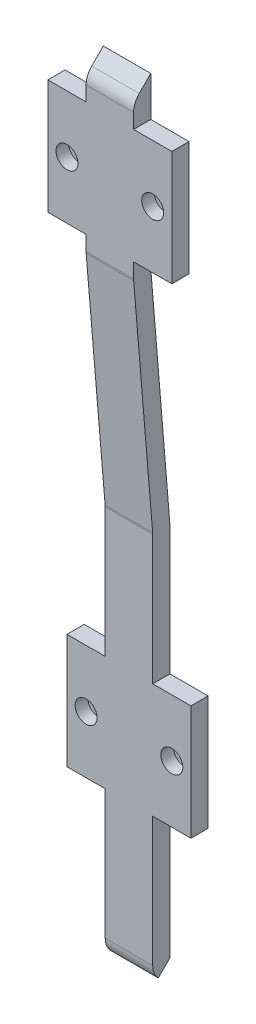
ISO-10303-21;
HEADER;
FILE_DESCRIPTION(('STEP AP214'),'2;1');
FILE_NAME('part.step','',(''),(''),'','','');
FILE_SCHEMA(('AUTOMOTIVE_DESIGN { 1 0 10303 214 1 1 1 1 }'));
ENDSEC;
DATA;
#1=APPLICATION_CONTEXT('core data for automotive mechanical design processes');
#2=APPLICATION_PROTOCOL_DEFINITION('international standard','automotive_design',2000,#1);
#3=PRODUCT_CONTEXT('',#1,'mechanical');
#4=PRODUCT('Part','Part','',(#3));
#5=PRODUCT_RELATED_PRODUCT_CATEGORY('part','',(#4));
#6=PRODUCT_DEFINITION_FORMATION('','',#4);
#7=PRODUCT_DEFINITION_CONTEXT('part definition',#1,'design');
#8=PRODUCT_DEFINITION('design','',#6,#7);
#9=PRODUCT_DEFINITION_SHAPE('','',#8);
#10=(LENGTH_UNIT() NAMED_UNIT(*) SI_UNIT(.MILLI.,.METRE.));
#11=(NAMED_UNIT(*) PLANE_ANGLE_UNIT() SI_UNIT($,.RADIAN.));
#12=(NAMED_UNIT(*) SI_UNIT($,.STERADIAN.) SOLID_ANGLE_UNIT());
#13=UNCERTAINTY_MEASURE_WITH_UNIT(LENGTH_MEASURE(1.E-05),#10,'distance_accuracy_value','');
#14=(GEOMETRIC_REPRESENTATION_CONTEXT(3) GLOBAL_UNCERTAINTY_ASSIGNED_CONTEXT((#13)) GLOBAL_UNIT_ASSIGNED_CONTEXT((#10,
#11,#12)) REPRESENTATION_CONTEXT('',''));
#15=CARTESIAN_POINT('',(0.,0.,0.));
#16=DIRECTION('',(0.,0.,1.));
#17=DIRECTION('',(1.,0.,0.));
#18=AXIS2_PLACEMENT_3D('',#15,#16,#17);
#19=CARTESIAN_POINT('',(-5.45311296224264,111.910721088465,-10.));
#20=DIRECTION('',(0.,0.,1.));
#21=DIRECTION('',(1.,0.,0.));
#22=AXIS2_PLACEMENT_3D('',#19,#20,#21);
#23=CYLINDRICAL_SURFACE('',#22,1.55);
#24=CARTESIAN_POINT('',(-5.45311296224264,111.910721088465,-4.5));
#25=DIRECTION('',(0.,0.,1.));
#26=DIRECTION('',(1.,0.,0.));
#27=AXIS2_PLACEMENT_3D('',#24,#25,#26);
#28=CIRCLE('',#27,1.55);
#29=CARTESIAN_POINT('',(-3.90311296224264,111.910721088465,-4.5));
#30=VERTEX_POINT('',#29);
#31=EDGE_CURVE('E432',#30,#30,#28,.F.);
#32=CARTESIAN_POINT('',(-5.45311296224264,111.910721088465,-3.3));
#33=DIRECTION('',(0.,0.,1.));
#34=DIRECTION('',(1.,0.,0.));
#35=AXIS2_PLACEMENT_3D('',#32,#33,#34);
#36=CIRCLE('',#35,1.55);
#37=CARTESIAN_POINT('',(-3.90311296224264,111.910721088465,-3.3));
#38=VERTEX_POINT('',#37);
#39=EDGE_CURVE('E377',#38,#38,#36,.F.);
#40=CARTESIAN_POINT('',(-3.90311296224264,111.910721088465,-4.5));
#41=CARTESIAN_POINT('',(-3.90311296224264,111.910721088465,-4.4875));
#42=CARTESIAN_POINT('',(-3.90311296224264,111.910721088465,-4.475));
#43=CARTESIAN_POINT('',(-3.90311296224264,111.910721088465,-4.45));
#44=CARTESIAN_POINT('',(-3.90311296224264,111.910721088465,-4.4375));
#45=CARTESIAN_POINT('',(-3.90311296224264,111.910721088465,-4.4125));
#46=CARTESIAN_POINT('',(-3.90311296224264,111.910721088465,-4.4));
#47=CARTESIAN_POINT('',(-3.90311296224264,111.910721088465,-4.375));
#48=CARTESIAN_POINT('',(-3.90311296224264,111.910721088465,-4.3625));
#49=CARTESIAN_POINT('',(-3.90311296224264,111.910721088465,-4.3375));
#50=CARTESIAN_POINT('',(-3.90311296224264,111.910721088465,-4.325));
#51=CARTESIAN_POINT('',(-3.90311296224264,111.910721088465,-4.3));
#52=CARTESIAN_POINT('',(-3.90311296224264,111.910721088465,-4.2875));
#53=CARTESIAN_POINT('',(-3.90311296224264,111.910721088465,-4.2625));
#54=CARTESIAN_POINT('',(-3.90311296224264,111.910721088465,-4.25));
#55=CARTESIAN_POINT('',(-3.90311296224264,111.910721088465,-4.225));
#56=CARTESIAN_POINT('',(-3.90311296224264,111.910721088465,-4.2125));
#57=CARTESIAN_POINT('',(-3.90311296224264,111.910721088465,-4.1875));
#58=CARTESIAN_POINT('',(-3.90311296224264,111.910721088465,-4.175));
#59=CARTESIAN_POINT('',(-3.90311296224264,111.910721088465,-4.15));
#60=CARTESIAN_POINT('',(-3.90311296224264,111.910721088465,-4.1375));
#61=CARTESIAN_POINT('',(-3.90311296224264,111.910721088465,-4.1125));
#62=CARTESIAN_POINT('',(-3.90311296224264,111.910721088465,-4.1));
#63=CARTESIAN_POINT('',(-3.90311296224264,111.910721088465,-4.075));
#64=CARTESIAN_POINT('',(-3.90311296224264,111.910721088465,-4.0625));
#65=CARTESIAN_POINT('',(-3.90311296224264,111.910721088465,-4.0375));
#66=CARTESIAN_POINT('',(-3.90311296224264,111.910721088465,-4.025));
#67=CARTESIAN_POINT('',(-3.90311296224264,111.910721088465,-4.));
#68=CARTESIAN_POINT('',(-3.90311296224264,111.910721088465,-3.9875));
#69=CARTESIAN_POINT('',(-3.90311296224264,111.910721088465,-3.9625));
#70=CARTESIAN_POINT('',(-3.90311296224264,111.910721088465,-3.95));
#71=CARTESIAN_POINT('',(-3.90311296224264,111.910721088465,-3.925));
#72=CARTESIAN_POINT('',(-3.90311296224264,111.910721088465,-3.9125));
#73=CARTESIAN_POINT('',(-3.90311296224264,111.910721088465,-3.8875));
#74=CARTESIAN_POINT('',(-3.90311296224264,111.910721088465,-3.875));
#75=CARTESIAN_POINT('',(-3.90311296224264,111.910721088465,-3.85));
#76=CARTESIAN_POINT('',(-3.90311296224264,111.910721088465,-3.8375));
#77=CARTESIAN_POINT('',(-3.90311296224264,111.910721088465,-3.8125));
#78=CARTESIAN_POINT('',(-3.90311296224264,111.910721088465,-3.8));
#79=CARTESIAN_POINT('',(-3.90311296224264,111.910721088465,-3.775));
#80=CARTESIAN_POINT('',(-3.90311296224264,111.910721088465,-3.7625));
#81=CARTESIAN_POINT('',(-3.90311296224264,111.910721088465,-3.7375));
#82=CARTESIAN_POINT('',(-3.90311296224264,111.910721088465,-3.725));
#83=CARTESIAN_POINT('',(-3.90311296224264,111.910721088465,-3.7));
#84=CARTESIAN_POINT('',(-3.90311296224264,111.910721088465,-3.6875));
#85=CARTESIAN_POINT('',(-3.90311296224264,111.910721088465,-3.6625));
#86=CARTESIAN_POINT('',(-3.90311296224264,111.910721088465,-3.65));
#87=CARTESIAN_POINT('',(-3.90311296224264,111.910721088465,-3.625));
#88=CARTESIAN_POINT('',(-3.90311296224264,111.910721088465,-3.6125));
#89=CARTESIAN_POINT('',(-3.90311296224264,111.910721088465,-3.5875));
#90=CARTESIAN_POINT('',(-3.90311296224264,111.910721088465,-3.575));
#91=CARTESIAN_POINT('',(-3.90311296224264,111.910721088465,-3.55));
#92=CARTESIAN_POINT('',(-3.90311296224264,111.910721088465,-3.5375));
#93=CARTESIAN_POINT('',(-3.90311296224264,111.910721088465,-3.5125));
#94=CARTESIAN_POINT('',(-3.90311296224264,111.910721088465,-3.5));
#95=CARTESIAN_POINT('',(-3.90311296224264,111.910721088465,-3.475));
#96=CARTESIAN_POINT('',(-3.90311296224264,111.910721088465,-3.4625));
#97=CARTESIAN_POINT('',(-3.90311296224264,111.910721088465,-3.4375));
#98=CARTESIAN_POINT('',(-3.90311296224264,111.910721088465,-3.425));
#99=CARTESIAN_POINT('',(-3.90311296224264,111.910721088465,-3.4));
#100=CARTESIAN_POINT('',(-3.90311296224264,111.910721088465,-3.3875));
#101=CARTESIAN_POINT('',(-3.90311296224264,111.910721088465,-3.3625));
#102=CARTESIAN_POINT('',(-3.90311296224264,111.910721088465,-3.35));
#103=CARTESIAN_POINT('',(-3.90311296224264,111.910721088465,-3.325));
#104=CARTESIAN_POINT('',(-3.90311296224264,111.910721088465,-3.3125));
#105=CARTESIAN_POINT('',(-3.90311296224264,111.910721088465,-3.3));
#106=B_SPLINE_CURVE_WITH_KNOTS('',3,(#40,#41,#42,#43,#44,#45,#46,#47,#48,#49,#50,#51,#52,#53,
#54,#55,#56,#57,#58,#59,#60,#61,#62,#63,#64,#65,#66,#67,#68,#69,#70,#71,#72,#73,#74,#75,#76,#77,
#78,#79,#80,#81,#82,#83,#84,#85,#86,#87,#88,#89,#90,#91,#92,#93,#94,#95,#96,#97,#98,#99,#100,
#101,#102,#103,#104,#105),.UNSPECIFIED.,.F.,.F.,(4,2,2,2,2,2,2,2,2,2,2,2,2,2,2,2,2,2,2,2,2,2,2,
2,2,2,2,2,2,2,2,2,4),(0.,0.0375000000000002,0.0750000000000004,0.1125,0.15,0.1875,0.225,
0.262500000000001,0.3,0.3375,0.375,0.412500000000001,0.450000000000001,0.487500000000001,0.525,
0.5625,0.600000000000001,0.637500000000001,0.675000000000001,0.712500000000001,
0.750000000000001,0.787500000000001,0.825000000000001,0.862500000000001,0.900000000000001,
0.937500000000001,0.975000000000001,1.0125,1.05,1.0875,1.125,1.1625,1.2),.UNSPECIFIED.);
#107=EDGE_CURVE('BSEAM36',#30,#38,#106,.T.);
#108=ORIENTED_EDGE('',*,*,#31,.T.);
#109=ORIENTED_EDGE('',*,*,#39,.F.);
#110=ORIENTED_EDGE('',*,*,#107,.T.);
#111=ORIENTED_EDGE('',*,*,#107,.F.);
#112=EDGE_LOOP('',(#108,#110,#109,#111));
#113=FACE_BOUND('',#112,.T.);
#114=ADVANCED_FACE('F36',(#113),#23,.F.);
#115=CARTESIAN_POINT('',(16.9782132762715,111.910721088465,-10.));
#116=DIRECTION('',(0.,0.,1.));
#117=DIRECTION('',(1.,0.,0.));
#118=AXIS2_PLACEMENT_3D('',#115,#116,#117);
#119=CYLINDRICAL_SURFACE('',#118,1.55);
#120=CARTESIAN_POINT('',(16.9782132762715,111.910721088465,-4.5));
#121=DIRECTION('',(0.,0.,1.));
#122=DIRECTION('',(1.,0.,0.));
#123=AXIS2_PLACEMENT_3D('',#120,#121,#122);
#124=CIRCLE('',#123,1.55);
#125=CARTESIAN_POINT('',(18.5282132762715,111.910721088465,-4.5));
#126=VERTEX_POINT('',#125);
#127=EDGE_CURVE('E429',#126,#126,#124,.F.);
#128=CARTESIAN_POINT('',(16.9782132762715,111.910721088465,-3.3));
#129=DIRECTION('',(0.,0.,1.));
#130=DIRECTION('',(1.,0.,0.));
#131=AXIS2_PLACEMENT_3D('',#128,#129,#130);
#132=CIRCLE('',#131,1.55);
#133=CARTESIAN_POINT('',(18.5282132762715,111.910721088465,-3.3));
#134=VERTEX_POINT('',#133);
#135=EDGE_CURVE('E374',#134,#134,#132,.F.);
#136=CARTESIAN_POINT('',(18.5282132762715,111.910721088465,-4.5));
#137=CARTESIAN_POINT('',(18.5282132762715,111.910721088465,-4.4875));
#138=CARTESIAN_POINT('',(18.5282132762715,111.910721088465,-4.475));
#139=CARTESIAN_POINT('',(18.5282132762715,111.910721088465,-4.45));
#140=CARTESIAN_POINT('',(18.5282132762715,111.910721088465,-4.4375));
#141=CARTESIAN_POINT('',(18.5282132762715,111.910721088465,-4.4125));
#142=CARTESIAN_POINT('',(18.5282132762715,111.910721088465,-4.4));
#143=CARTESIAN_POINT('',(18.5282132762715,111.910721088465,-4.375));
#144=CARTESIAN_POINT('',(18.5282132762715,111.910721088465,-4.3625));
#145=CARTESIAN_POINT('',(18.5282132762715,111.910721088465,-4.3375));
#146=CARTESIAN_POINT('',(18.5282132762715,111.910721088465,-4.325));
#147=CARTESIAN_POINT('',(18.5282132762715,111.910721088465,-4.3));
#148=CARTESIAN_POINT('',(18.5282132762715,111.910721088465,-4.2875));
#149=CARTESIAN_POINT('',(18.5282132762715,111.910721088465,-4.2625));
#150=CARTESIAN_POINT('',(18.5282132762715,111.910721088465,-4.25));
#151=CARTESIAN_POINT('',(18.5282132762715,111.910721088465,-4.225));
#152=CARTESIAN_POINT('',(18.5282132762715,111.910721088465,-4.2125));
#153=CARTESIAN_POINT('',(18.5282132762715,111.910721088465,-4.1875));
#154=CARTESIAN_POINT('',(18.5282132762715,111.910721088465,-4.175));
#155=CARTESIAN_POINT('',(18.5282132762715,111.910721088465,-4.15));
#156=CARTESIAN_POINT('',(18.5282132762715,111.910721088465,-4.1375));
#157=CARTESIAN_POINT('',(18.5282132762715,111.910721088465,-4.1125));
#158=CARTESIAN_POINT('',(18.5282132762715,111.910721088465,-4.1));
#159=CARTESIAN_POINT('',(18.5282132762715,111.910721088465,-4.075));
#160=CARTESIAN_POINT('',(18.5282132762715,111.910721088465,-4.0625));
#161=CARTESIAN_POINT('',(18.5282132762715,111.910721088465,-4.0375));
#162=CARTESIAN_POINT('',(18.5282132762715,111.910721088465,-4.025));
#163=CARTESIAN_POINT('',(18.5282132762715,111.910721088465,-4.));
#164=CARTESIAN_POINT('',(18.5282132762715,111.910721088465,-3.9875));
#165=CARTESIAN_POINT('',(18.5282132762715,111.910721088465,-3.9625));
#166=CARTESIAN_POINT('',(18.5282132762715,111.910721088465,-3.95));
#167=CARTESIAN_POINT('',(18.5282132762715,111.910721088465,-3.925));
#168=CARTESIAN_POINT('',(18.5282132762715,111.910721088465,-3.9125));
#169=CARTESIAN_POINT('',(18.5282132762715,111.910721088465,-3.8875));
#170=CARTESIAN_POINT('',(18.5282132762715,111.910721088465,-3.875));
#171=CARTESIAN_POINT('',(18.5282132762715,111.910721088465,-3.85));
#172=CARTESIAN_POINT('',(18.5282132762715,111.910721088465,-3.8375));
#173=CARTESIAN_POINT('',(18.5282132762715,111.910721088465,-3.8125));
#174=CARTESIAN_POINT('',(18.5282132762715,111.910721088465,-3.8));
#175=CARTESIAN_POINT('',(18.5282132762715,111.910721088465,-3.775));
#176=CARTESIAN_POINT('',(18.5282132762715,111.910721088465,-3.7625));
#177=CARTESIAN_POINT('',(18.5282132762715,111.910721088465,-3.7375));
#178=CARTESIAN_POINT('',(18.5282132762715,111.910721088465,-3.725));
#179=CARTESIAN_POINT('',(18.5282132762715,111.910721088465,-3.7));
#180=CARTESIAN_POINT('',(18.5282132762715,111.910721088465,-3.6875));
#181=CARTESIAN_POINT('',(18.5282132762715,111.910721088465,-3.6625));
#182=CARTESIAN_POINT('',(18.5282132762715,111.910721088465,-3.65));
#183=CARTESIAN_POINT('',(18.5282132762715,111.910721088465,-3.625));
#184=CARTESIAN_POINT('',(18.5282132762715,111.910721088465,-3.6125));
#185=CARTESIAN_POINT('',(18.5282132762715,111.910721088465,-3.5875));
#186=CARTESIAN_POINT('',(18.5282132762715,111.910721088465,-3.575));
#187=CARTESIAN_POINT('',(18.5282132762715,111.910721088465,-3.55));
#188=CARTESIAN_POINT('',(18.5282132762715,111.910721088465,-3.5375));
#189=CARTESIAN_POINT('',(18.5282132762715,111.910721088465,-3.5125));
#190=CARTESIAN_POINT('',(18.5282132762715,111.910721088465,-3.5));
#191=CARTESIAN_POINT('',(18.5282132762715,111.910721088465,-3.475));
#192=CARTESIAN_POINT('',(18.5282132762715,111.910721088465,-3.4625));
#193=CARTESIAN_POINT('',(18.5282132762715,111.910721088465,-3.4375));
#194=CARTESIAN_POINT('',(18.5282132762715,111.910721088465,-3.425));
#195=CARTESIAN_POINT('',(18.5282132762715,111.910721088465,-3.4));
#196=CARTESIAN_POINT('',(18.5282132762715,111.910721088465,-3.3875));
#197=CARTESIAN_POINT('',(18.5282132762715,111.910721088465,-3.3625));
#198=CARTESIAN_POINT('',(18.5282132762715,111.910721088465,-3.35));
#199=CARTESIAN_POINT('',(18.5282132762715,111.910721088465,-3.325));
#200=CARTESIAN_POINT('',(18.5282132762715,111.910721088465,-3.3125));
#201=CARTESIAN_POINT('',(18.5282132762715,111.910721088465,-3.3));
#202=B_SPLINE_CURVE_WITH_KNOTS('',3,(#136,#137,#138,#139,#140,#141,#142,#143,#144,#145,#146,
#147,#148,#149,#150,#151,#152,#153,#154,#155,#156,#157,#158,#159,#160,#161,#162,#163,#164,#165,
#166,#167,#168,#169,#170,#171,#172,#173,#174,#175,#176,#177,#178,#179,#180,#181,#182,#183,#184,
#185,#186,#187,#188,#189,#190,#191,#192,#193,#194,#195,#196,#197,#198,#199,#200,#201),
.UNSPECIFIED.,.F.,.F.,(4,2,2,2,2,2,2,2,2,2,2,2,2,2,2,2,2,2,2,2,2,2,2,2,2,2,2,2,2,2,2,2,4),(0.,
0.0375000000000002,0.0750000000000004,0.1125,0.15,0.1875,0.225,0.262500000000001,0.3,0.3375,
0.375,0.412500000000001,0.450000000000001,0.487500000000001,0.525,0.5625,0.600000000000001,
0.637500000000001,0.675000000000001,0.712500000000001,0.750000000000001,0.787500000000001,
0.825000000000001,0.862500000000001,0.900000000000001,0.937500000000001,0.975000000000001,
1.0125,1.05,1.0875,1.125,1.1625,1.2),.UNSPECIFIED.);
#203=EDGE_CURVE('BSEAM513',#126,#134,#202,.T.);
#204=ORIENTED_EDGE('',*,*,#127,.T.);
#205=ORIENTED_EDGE('',*,*,#135,.F.);
#206=ORIENTED_EDGE('',*,*,#203,.T.);
#207=ORIENTED_EDGE('',*,*,#203,.F.);
#208=EDGE_LOOP('',(#204,#206,#205,#207));
#209=FACE_BOUND('',#208,.T.);
#210=ADVANCED_FACE('F513',(#209),#119,.F.);
#211=CARTESIAN_POINT('',(16.9782132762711,-16.2261839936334,-10.));
#212=DIRECTION('',(0.,0.,1.));
#213=DIRECTION('',(1.,0.,0.));
#214=AXIS2_PLACEMENT_3D('',#211,#212,#213);
#215=CYLINDRICAL_SURFACE('',#214,1.55);
#216=CARTESIAN_POINT('',(16.9782132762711,-16.2261839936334,-9.50000000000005));
#217=DIRECTION('',(0.,0.,1.));
#218=DIRECTION('',(1.,0.,0.));
#219=AXIS2_PLACEMENT_3D('',#216,#217,#218);
#220=CIRCLE('',#219,1.55);
#221=CARTESIAN_POINT('',(18.5282132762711,-16.2261839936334,-9.50000000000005));
#222=VERTEX_POINT('',#221);
#223=EDGE_CURVE('E398',#222,#222,#220,.F.);
#224=CARTESIAN_POINT('',(16.9782132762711,-16.2261839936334,-8.30000000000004));
#225=DIRECTION('',(0.,0.,1.));
#226=DIRECTION('',(1.,0.,0.));
#227=AXIS2_PLACEMENT_3D('',#224,#225,#226);
#228=CIRCLE('',#227,1.55);
#229=CARTESIAN_POINT('',(18.5282132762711,-16.2261839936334,-8.30000000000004));
#230=VERTEX_POINT('',#229);
#231=EDGE_CURVE('E369',#230,#230,#228,.F.);
#232=CARTESIAN_POINT('',(18.5282132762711,-16.2261839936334,-9.50000000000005));
#233=CARTESIAN_POINT('',(18.5282132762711,-16.2261839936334,-9.48750000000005));
#234=CARTESIAN_POINT('',(18.5282132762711,-16.2261839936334,-9.47500000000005));
#235=CARTESIAN_POINT('',(18.5282132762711,-16.2261839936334,-9.45000000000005));
#236=CARTESIAN_POINT('',(18.5282132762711,-16.2261839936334,-9.43750000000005));
#237=CARTESIAN_POINT('',(18.5282132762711,-16.2261839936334,-9.41250000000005));
#238=CARTESIAN_POINT('',(18.5282132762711,-16.2261839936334,-9.40000000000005));
#239=CARTESIAN_POINT('',(18.5282132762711,-16.2261839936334,-9.37500000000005));
#240=CARTESIAN_POINT('',(18.5282132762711,-16.2261839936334,-9.36250000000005));
#241=CARTESIAN_POINT('',(18.5282132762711,-16.2261839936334,-9.33750000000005));
#242=CARTESIAN_POINT('',(18.5282132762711,-16.2261839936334,-9.32500000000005));
#243=CARTESIAN_POINT('',(18.5282132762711,-16.2261839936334,-9.30000000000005));
#244=CARTESIAN_POINT('',(18.5282132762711,-16.2261839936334,-9.28750000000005));
#245=CARTESIAN_POINT('',(18.5282132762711,-16.2261839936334,-9.26250000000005));
#246=CARTESIAN_POINT('',(18.5282132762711,-16.2261839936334,-9.25000000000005));
#247=CARTESIAN_POINT('',(18.5282132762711,-16.2261839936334,-9.22500000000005));
#248=CARTESIAN_POINT('',(18.5282132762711,-16.2261839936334,-9.21250000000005));
#249=CARTESIAN_POINT('',(18.5282132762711,-16.2261839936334,-9.18750000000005));
#250=CARTESIAN_POINT('',(18.5282132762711,-16.2261839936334,-9.17500000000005));
#251=CARTESIAN_POINT('',(18.5282132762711,-16.2261839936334,-9.15000000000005));
#252=CARTESIAN_POINT('',(18.5282132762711,-16.2261839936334,-9.13750000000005));
#253=CARTESIAN_POINT('',(18.5282132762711,-16.2261839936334,-9.11250000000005));
#254=CARTESIAN_POINT('',(18.5282132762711,-16.2261839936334,-9.10000000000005));
#255=CARTESIAN_POINT('',(18.5282132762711,-16.2261839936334,-9.07500000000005));
#256=CARTESIAN_POINT('',(18.5282132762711,-16.2261839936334,-9.06250000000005));
#257=CARTESIAN_POINT('',(18.5282132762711,-16.2261839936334,-9.03750000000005));
#258=CARTESIAN_POINT('',(18.5282132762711,-16.2261839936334,-9.02500000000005));
#259=CARTESIAN_POINT('',(18.5282132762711,-16.2261839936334,-9.00000000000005));
#260=CARTESIAN_POINT('',(18.5282132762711,-16.2261839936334,-8.98750000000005));
#261=CARTESIAN_POINT('',(18.5282132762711,-16.2261839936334,-8.96250000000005));
#262=CARTESIAN_POINT('',(18.5282132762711,-16.2261839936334,-8.95000000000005));
#263=CARTESIAN_POINT('',(18.5282132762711,-16.2261839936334,-8.92500000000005));
#264=CARTESIAN_POINT('',(18.5282132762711,-16.2261839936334,-8.91250000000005));
#265=CARTESIAN_POINT('',(18.5282132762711,-16.2261839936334,-8.88750000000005));
#266=CARTESIAN_POINT('',(18.5282132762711,-16.2261839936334,-8.87500000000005));
#267=CARTESIAN_POINT('',(18.5282132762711,-16.2261839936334,-8.85000000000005));
#268=CARTESIAN_POINT('',(18.5282132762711,-16.2261839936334,-8.83750000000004));
#269=CARTESIAN_POINT('',(18.5282132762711,-16.2261839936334,-8.81250000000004));
#270=CARTESIAN_POINT('',(18.5282132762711,-16.2261839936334,-8.80000000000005));
#271=CARTESIAN_POINT('',(18.5282132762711,-16.2261839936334,-8.77500000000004));
#272=CARTESIAN_POINT('',(18.5282132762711,-16.2261839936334,-8.76250000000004));
#273=CARTESIAN_POINT('',(18.5282132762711,-16.2261839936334,-8.73750000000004));
#274=CARTESIAN_POINT('',(18.5282132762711,-16.2261839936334,-8.72500000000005));
#275=CARTESIAN_POINT('',(18.5282132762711,-16.2261839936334,-8.70000000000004));
#276=CARTESIAN_POINT('',(18.5282132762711,-16.2261839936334,-8.68750000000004));
#277=CARTESIAN_POINT('',(18.5282132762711,-16.2261839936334,-8.66250000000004));
#278=CARTESIAN_POINT('',(18.5282132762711,-16.2261839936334,-8.65000000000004));
#279=CARTESIAN_POINT('',(18.5282132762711,-16.2261839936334,-8.62500000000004));
#280=CARTESIAN_POINT('',(18.5282132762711,-16.2261839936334,-8.61250000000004));
#281=CARTESIAN_POINT('',(18.5282132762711,-16.2261839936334,-8.58750000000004));
#282=CARTESIAN_POINT('',(18.5282132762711,-16.2261839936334,-8.57500000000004));
#283=CARTESIAN_POINT('',(18.5282132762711,-16.2261839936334,-8.55000000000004));
#284=CARTESIAN_POINT('',(18.5282132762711,-16.2261839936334,-8.53750000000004));
#285=CARTESIAN_POINT('',(18.5282132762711,-16.2261839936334,-8.51250000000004));
#286=CARTESIAN_POINT('',(18.5282132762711,-16.2261839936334,-8.50000000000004));
#287=CARTESIAN_POINT('',(18.5282132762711,-16.2261839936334,-8.47500000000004));
#288=CARTESIAN_POINT('',(18.5282132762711,-16.2261839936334,-8.46250000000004));
#289=CARTESIAN_POINT('',(18.5282132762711,-16.2261839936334,-8.43750000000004));
#290=CARTESIAN_POINT('',(18.5282132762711,-16.2261839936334,-8.42500000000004));
#291=CARTESIAN_POINT('',(18.5282132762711,-16.2261839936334,-8.40000000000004));
#292=CARTESIAN_POINT('',(18.5282132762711,-16.2261839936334,-8.38750000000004));
#293=CARTESIAN_POINT('',(18.5282132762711,-16.2261839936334,-8.36250000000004));
#294=CARTESIAN_POINT('',(18.5282132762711,-16.2261839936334,-8.35000000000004));
#295=CARTESIAN_POINT('',(18.5282132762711,-16.2261839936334,-8.32500000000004));
#296=CARTESIAN_POINT('',(18.5282132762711,-16.2261839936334,-8.31250000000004));
#297=CARTESIAN_POINT('',(18.5282132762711,-16.2261839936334,-8.30000000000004));
#298=B_SPLINE_CURVE_WITH_KNOTS('',3,(#232,#233,#234,#235,#236,#237,#238,#239,#240,#241,#242,
#243,#244,#245,#246,#247,#248,#249,#250,#251,#252,#253,#254,#255,#256,#257,#258,#259,#260,#261,
#262,#263,#264,#265,#266,#267,#268,#269,#270,#271,#272,#273,#274,#275,#276,#277,#278,#279,#280,
#281,#282,#283,#284,#285,#286,#287,#288,#289,#290,#291,#292,#293,#294,#295,#296,#297),
.UNSPECIFIED.,.F.,.F.,(4,2,2,2,2,2,2,2,2,2,2,2,2,2,2,2,2,2,2,2,2,2,2,2,2,2,2,2,2,2,2,2,4),(0.,
0.0375000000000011,0.0750000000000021,0.112500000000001,0.150000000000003,0.187500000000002,
0.225000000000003,0.262500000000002,0.300000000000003,0.337500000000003,0.375000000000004,
0.412500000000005,0.450000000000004,0.487500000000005,0.525000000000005,0.562500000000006,
0.600000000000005,0.637500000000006,0.675000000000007,0.712500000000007,0.750000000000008,
0.787500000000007,0.825000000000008,0.862500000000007,0.900000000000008,0.937500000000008,
0.975000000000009,1.01250000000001,1.05000000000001,1.08750000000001,1.12500000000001,
1.16250000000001,1.20000000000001),.UNSPECIFIED.);
#299=EDGE_CURVE('BSEAM496',#222,#230,#298,.T.);
#300=ORIENTED_EDGE('',*,*,#223,.T.);
#301=ORIENTED_EDGE('',*,*,#231,.F.);
#302=ORIENTED_EDGE('',*,*,#299,.T.);
#303=ORIENTED_EDGE('',*,*,#299,.F.);
#304=EDGE_LOOP('',(#300,#302,#301,#303));
#305=FACE_BOUND('',#304,.T.);
#306=ADVANCED_FACE('F496',(#305),#215,.F.);
#307=CARTESIAN_POINT('',(-5.45311296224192,-16.2261839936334,-10.));
#308=DIRECTION('',(0.,0.,1.));
#309=DIRECTION('',(1.,0.,0.));
#310=AXIS2_PLACEMENT_3D('',#307,#308,#309);
#311=CYLINDRICAL_SURFACE('',#310,1.55);
#312=CARTESIAN_POINT('',(-5.45311296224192,-16.2261839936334,-9.50000000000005));
#313=DIRECTION('',(0.,0.,1.));
#314=DIRECTION('',(1.,0.,0.));
#315=AXIS2_PLACEMENT_3D('',#312,#313,#314);
#316=CIRCLE('',#315,1.55);
#317=CARTESIAN_POINT('',(-3.90311296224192,-16.2261839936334,-9.50000000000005));
#318=VERTEX_POINT('',#317);
#319=EDGE_CURVE('E487',#318,#318,#316,.F.);
#320=CARTESIAN_POINT('',(-5.45311296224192,-16.2261839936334,-8.30000000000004));
#321=DIRECTION('',(0.,0.,1.));
#322=DIRECTION('',(1.,0.,0.));
#323=AXIS2_PLACEMENT_3D('',#320,#321,#322);
#324=CIRCLE('',#323,1.55);
#325=CARTESIAN_POINT('',(-3.90311296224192,-16.2261839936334,-8.30000000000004));
#326=VERTEX_POINT('',#325);
#327=EDGE_CURVE('E366',#326,#326,#324,.F.);
#328=CARTESIAN_POINT('',(-3.90311296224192,-16.2261839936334,-9.50000000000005));
#329=CARTESIAN_POINT('',(-3.90311296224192,-16.2261839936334,-9.48750000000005));
#330=CARTESIAN_POINT('',(-3.90311296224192,-16.2261839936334,-9.47500000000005));
#331=CARTESIAN_POINT('',(-3.90311296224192,-16.2261839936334,-9.45000000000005));
#332=CARTESIAN_POINT('',(-3.90311296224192,-16.2261839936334,-9.43750000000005));
#333=CARTESIAN_POINT('',(-3.90311296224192,-16.2261839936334,-9.41250000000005));
#334=CARTESIAN_POINT('',(-3.90311296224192,-16.2261839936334,-9.40000000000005));
#335=CARTESIAN_POINT('',(-3.90311296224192,-16.2261839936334,-9.37500000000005));
#336=CARTESIAN_POINT('',(-3.90311296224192,-16.2261839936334,-9.36250000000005));
#337=CARTESIAN_POINT('',(-3.90311296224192,-16.2261839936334,-9.33750000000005));
#338=CARTESIAN_POINT('',(-3.90311296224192,-16.2261839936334,-9.32500000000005));
#339=CARTESIAN_POINT('',(-3.90311296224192,-16.2261839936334,-9.30000000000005));
#340=CARTESIAN_POINT('',(-3.90311296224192,-16.2261839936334,-9.28750000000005));
#341=CARTESIAN_POINT('',(-3.90311296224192,-16.2261839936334,-9.26250000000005));
#342=CARTESIAN_POINT('',(-3.90311296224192,-16.2261839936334,-9.25000000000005));
#343=CARTESIAN_POINT('',(-3.90311296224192,-16.2261839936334,-9.22500000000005));
#344=CARTESIAN_POINT('',(-3.90311296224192,-16.2261839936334,-9.21250000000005));
#345=CARTESIAN_POINT('',(-3.90311296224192,-16.2261839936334,-9.18750000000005));
#346=CARTESIAN_POINT('',(-3.90311296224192,-16.2261839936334,-9.17500000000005));
#347=CARTESIAN_POINT('',(-3.90311296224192,-16.2261839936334,-9.15000000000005));
#348=CARTESIAN_POINT('',(-3.90311296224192,-16.2261839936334,-9.13750000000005));
#349=CARTESIAN_POINT('',(-3.90311296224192,-16.2261839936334,-9.11250000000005));
#350=CARTESIAN_POINT('',(-3.90311296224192,-16.2261839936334,-9.10000000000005));
#351=CARTESIAN_POINT('',(-3.90311296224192,-16.2261839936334,-9.07500000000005));
#352=CARTESIAN_POINT('',(-3.90311296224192,-16.2261839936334,-9.06250000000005));
#353=CARTESIAN_POINT('',(-3.90311296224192,-16.2261839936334,-9.03750000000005));
#354=CARTESIAN_POINT('',(-3.90311296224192,-16.2261839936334,-9.02500000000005));
#355=CARTESIAN_POINT('',(-3.90311296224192,-16.2261839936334,-9.00000000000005));
#356=CARTESIAN_POINT('',(-3.90311296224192,-16.2261839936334,-8.98750000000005));
#357=CARTESIAN_POINT('',(-3.90311296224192,-16.2261839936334,-8.96250000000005));
#358=CARTESIAN_POINT('',(-3.90311296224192,-16.2261839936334,-8.95000000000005));
#359=CARTESIAN_POINT('',(-3.90311296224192,-16.2261839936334,-8.92500000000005));
#360=CARTESIAN_POINT('',(-3.90311296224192,-16.2261839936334,-8.91250000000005));
#361=CARTESIAN_POINT('',(-3.90311296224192,-16.2261839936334,-8.88750000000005));
#362=CARTESIAN_POINT('',(-3.90311296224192,-16.2261839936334,-8.87500000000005));
#363=CARTESIAN_POINT('',(-3.90311296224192,-16.2261839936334,-8.85000000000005));
#364=CARTESIAN_POINT('',(-3.90311296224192,-16.2261839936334,-8.83750000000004));
#365=CARTESIAN_POINT('',(-3.90311296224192,-16.2261839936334,-8.81250000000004));
#366=CARTESIAN_POINT('',(-3.90311296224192,-16.2261839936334,-8.80000000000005));
#367=CARTESIAN_POINT('',(-3.90311296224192,-16.2261839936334,-8.77500000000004));
#368=CARTESIAN_POINT('',(-3.90311296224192,-16.2261839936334,-8.76250000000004));
#369=CARTESIAN_POINT('',(-3.90311296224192,-16.2261839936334,-8.73750000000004));
#370=CARTESIAN_POINT('',(-3.90311296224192,-16.2261839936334,-8.72500000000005));
#371=CARTESIAN_POINT('',(-3.90311296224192,-16.2261839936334,-8.70000000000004));
#372=CARTESIAN_POINT('',(-3.90311296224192,-16.2261839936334,-8.68750000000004));
#373=CARTESIAN_POINT('',(-3.90311296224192,-16.2261839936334,-8.66250000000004));
#374=CARTESIAN_POINT('',(-3.90311296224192,-16.2261839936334,-8.65000000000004));
#375=CARTESIAN_POINT('',(-3.90311296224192,-16.2261839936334,-8.62500000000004));
#376=CARTESIAN_POINT('',(-3.90311296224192,-16.2261839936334,-8.61250000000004));
#377=CARTESIAN_POINT('',(-3.90311296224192,-16.2261839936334,-8.58750000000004));
#378=CARTESIAN_POINT('',(-3.90311296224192,-16.2261839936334,-8.57500000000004));
#379=CARTESIAN_POINT('',(-3.90311296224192,-16.2261839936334,-8.55000000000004));
#380=CARTESIAN_POINT('',(-3.90311296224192,-16.2261839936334,-8.53750000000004));
#381=CARTESIAN_POINT('',(-3.90311296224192,-16.2261839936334,-8.51250000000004));
#382=CARTESIAN_POINT('',(-3.90311296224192,-16.2261839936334,-8.50000000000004));
#383=CARTESIAN_POINT('',(-3.90311296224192,-16.2261839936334,-8.47500000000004));
#384=CARTESIAN_POINT('',(-3.90311296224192,-16.2261839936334,-8.46250000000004));
#385=CARTESIAN_POINT('',(-3.90311296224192,-16.2261839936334,-8.43750000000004));
#386=CARTESIAN_POINT('',(-3.90311296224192,-16.2261839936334,-8.42500000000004));
#387=CARTESIAN_POINT('',(-3.90311296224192,-16.2261839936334,-8.40000000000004));
#388=CARTESIAN_POINT('',(-3.90311296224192,-16.2261839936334,-8.38750000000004));
#389=CARTESIAN_POINT('',(-3.90311296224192,-16.2261839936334,-8.36250000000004));
#390=CARTESIAN_POINT('',(-3.90311296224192,-16.2261839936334,-8.35000000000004));
#391=CARTESIAN_POINT('',(-3.90311296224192,-16.2261839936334,-8.32500000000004));
#392=CARTESIAN_POINT('',(-3.90311296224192,-16.2261839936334,-8.31250000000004));
#393=CARTESIAN_POINT('',(-3.90311296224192,-16.2261839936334,-8.30000000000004));
#394=B_SPLINE_CURVE_WITH_KNOTS('',3,(#328,#329,#330,#331,#332,#333,#334,#335,#336,#337,#338,
#339,#340,#341,#342,#343,#344,#345,#346,#347,#348,#349,#350,#351,#352,#353,#354,#355,#356,#357,
#358,#359,#360,#361,#362,#363,#364,#365,#366,#367,#368,#369,#370,#371,#372,#373,#374,#375,#376,
#377,#378,#379,#380,#381,#382,#383,#384,#385,#386,#387,#388,#389,#390,#391,#392,#393),
.UNSPECIFIED.,.F.,.F.,(4,2,2,2,2,2,2,2,2,2,2,2,2,2,2,2,2,2,2,2,2,2,2,2,2,2,2,2,2,2,2,2,4),(0.,
0.0375000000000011,0.0750000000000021,0.112500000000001,0.150000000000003,0.187500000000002,
0.225000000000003,0.262500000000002,0.300000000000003,0.337500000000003,0.375000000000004,
0.412500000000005,0.450000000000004,0.487500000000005,0.525000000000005,0.562500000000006,
0.600000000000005,0.637500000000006,0.675000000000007,0.712500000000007,0.750000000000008,
0.787500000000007,0.825000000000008,0.862500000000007,0.900000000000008,0.937500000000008,
0.975000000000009,1.01250000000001,1.05000000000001,1.08750000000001,1.12500000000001,
1.16250000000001,1.20000000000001),.UNSPECIFIED.);
#395=EDGE_CURVE('BSEAM524',#318,#326,#394,.T.);
#396=ORIENTED_EDGE('',*,*,#319,.T.);
#397=ORIENTED_EDGE('',*,*,#327,.F.);
#398=ORIENTED_EDGE('',*,*,#395,.T.);
#399=ORIENTED_EDGE('',*,*,#395,.F.);
#400=EDGE_LOOP('',(#396,#398,#397,#399));
#401=FACE_BOUND('',#400,.T.);
#402=ADVANCED_FACE('F524',(#401),#311,.F.);
#403=CARTESIAN_POINT('',(-0.453112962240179,96.9107210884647,-5.));
#404=DIRECTION('',(-1.,0.,0.));
#405=DIRECTION('',(0.,-1.,0.));
#406=AXIS2_PLACEMENT_3D('',#403,#404,#405);
#407=PLANE('',#406);
#408=DIRECTION('',(0.,1.,0.));
#409=VECTOR('',#408,1.);
#410=CARTESIAN_POINT('',(-0.453112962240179,96.9107210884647,-9.50000000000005));
#411=LINE('',#410,#409);
#412=CARTESIAN_POINT('',(-0.453112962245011,-65.5866636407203,-9.50000000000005));
#413=VERTEX_POINT('',#412);
#414=CARTESIAN_POINT('',(-0.453112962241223,-31.2261839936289,-9.50000000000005));
#415=VERTEX_POINT('',#414);
#416=EDGE_CURVE('E231',#413,#415,#411,.T.);
#417=ORIENTED_EDGE('',*,*,#416,.F.);
#418=DIRECTION('',(0.,0.707106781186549,-0.707106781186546));
#419=VECTOR('',#418,1.);
#420=CARTESIAN_POINT('',(-0.4531129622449,-65.0866636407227,-9.99999999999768));
#421=LINE('',#420,#419);
#422=CARTESIAN_POINT('',(-0.453112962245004,-68.6221975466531,-6.46446609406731));
#423=VERTEX_POINT('',#422);
#424=EDGE_CURVE('E254',#423,#413,#421,.T.);
#425=ORIENTED_EDGE('',*,*,#424,.F.);
#426=CARTESIAN_POINT('',(-0.4531129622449,-65.0866636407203,-10.));
#427=DIRECTION('',(-1.,0.,0.));
#428=DIRECTION('',(0.,-1.,0.));
#429=AXIS2_PLACEMENT_3D('',#426,#427,#428);
#430=CIRCLE('',#429,5.00000000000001);
#431=CARTESIAN_POINT('',(-0.453112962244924,-65.0866636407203,-5.00000000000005));
#432=VERTEX_POINT('',#431);
#433=EDGE_CURVE('E269',#432,#423,#430,.F.);
#434=ORIENTED_EDGE('',*,*,#433,.F.);
#435=DIRECTION('',(0.,-1.,0.));
#436=VECTOR('',#435,1.);
#437=CARTESIAN_POINT('',(-0.453112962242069,32.634295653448,-5.00000000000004));
#438=LINE('',#437,#436);
#439=CARTESIAN_POINT('',(-0.453112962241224,-31.2261839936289,-5.00000000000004));
#440=VERTEX_POINT('',#439);
#441=EDGE_CURVE('E268',#440,#432,#438,.T.);
#442=ORIENTED_EDGE('',*,*,#441,.F.);
#443=DIRECTION('',(0.,0.,1.));
#444=VECTOR('',#443,1.);
#445=CARTESIAN_POINT('',(-0.453112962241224,-31.2261839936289,-41.6227766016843));
#446=LINE('',#445,#444);
#447=EDGE_CURVE('E460',#415,#440,#446,.T.);
#448=ORIENTED_EDGE('',*,*,#447,.F.);
#449=EDGE_LOOP('',(#417,#425,#434,#442,#448));
#450=FACE_BOUND('',#449,.T.);
#451=ADVANCED_FACE('F585',(#450),#407,.T.);
#452=CARTESIAN_POINT('',(11.978213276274,96.9107210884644,-5.));
#453=DIRECTION('',(1.,0.,0.));
#454=DIRECTION('',(0.,0.,-1.));
#455=AXIS2_PLACEMENT_3D('',#452,#453,#454);
#456=PLANE('',#455);
#457=DIRECTION('',(0.,-1.,0.));
#458=VECTOR('',#457,1.);
#459=CARTESIAN_POINT('',(11.978213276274,96.9107210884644,-9.50000000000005));
#460=LINE('',#459,#458);
#461=CARTESIAN_POINT('',(11.978213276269,-31.2261839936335,-9.50000000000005));
#462=VERTEX_POINT('',#461);
#463=CARTESIAN_POINT('',(11.978213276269,-65.5866636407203,-9.50000000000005));
#464=VERTEX_POINT('',#463);
#465=EDGE_CURVE('E485',#462,#464,#460,.T.);
#466=ORIENTED_EDGE('',*,*,#465,.F.);
#467=DIRECTION('',(0.,0.,1.));
#468=VECTOR('',#467,1.);
#469=CARTESIAN_POINT('',(11.9782132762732,-31.2261839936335,-41.6227766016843));
#470=LINE('',#469,#468);
#471=CARTESIAN_POINT('',(11.978213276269,-31.2261839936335,-5.00000000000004));
#472=VERTEX_POINT('',#471);
#473=EDGE_CURVE('E59',#462,#472,#470,.T.);
#474=ORIENTED_EDGE('',*,*,#473,.T.);
#475=DIRECTION('',(0.,-1.,0.));
#476=VECTOR('',#475,1.);
#477=CARTESIAN_POINT('',(11.978213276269,32.6342956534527,-5.00000000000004));
#478=LINE('',#477,#476);
#479=CARTESIAN_POINT('',(11.978213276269,-65.0866636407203,-5.00000000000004));
#480=VERTEX_POINT('',#479);
#481=EDGE_CURVE('E298',#472,#480,#478,.T.);
#482=ORIENTED_EDGE('',*,*,#481,.T.);
#483=CARTESIAN_POINT('',(11.978213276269,-65.0866636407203,-10.));
#484=DIRECTION('',(1.,0.,0.));
#485=DIRECTION('',(0.,0.,-1.));
#486=AXIS2_PLACEMENT_3D('',#483,#484,#485);
#487=CIRCLE('',#486,5.00000000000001);
#488=CARTESIAN_POINT('',(11.978213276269,-68.6221975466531,-6.46446609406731));
#489=VERTEX_POINT('',#488);
#490=EDGE_CURVE('E299',#480,#489,#487,.T.);
#491=ORIENTED_EDGE('',*,*,#490,.T.);
#492=DIRECTION('',(0.,0.707106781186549,-0.707106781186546));
#493=VECTOR('',#492,1.);
#494=CARTESIAN_POINT('',(11.978213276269,-65.0866636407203,-10.));
#495=LINE('',#494,#493);
#496=EDGE_CURVE('E284',#489,#464,#495,.T.);
#497=ORIENTED_EDGE('',*,*,#496,.T.);
#498=EDGE_LOOP('',(#466,#474,#482,#491,#497));
#499=FACE_BOUND('',#498,.T.);
#500=ADVANCED_FACE('F580',(#499),#456,.T.);
#501=CARTESIAN_POINT('',(11.978213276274,96.9107210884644,-5.));
#502=DIRECTION('',(0.,-1.,0.));
#503=DIRECTION('',(0.,0.,-1.));
#504=AXIS2_PLACEMENT_3D('',#501,#502,#503);
#505=PLANE('',#504);
#506=DIRECTION('',(-1.,0.,0.));
#507=VECTOR('',#506,1.);
#508=CARTESIAN_POINT('',(11.978213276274,96.9107210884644,-4.5));
#509=LINE('',#508,#507);
#510=CARTESIAN_POINT('',(21.9782132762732,96.9107210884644,-4.5));
#511=VERTEX_POINT('',#510);
#512=CARTESIAN_POINT('',(11.978213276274,96.9107210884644,-4.5));
#513=VERTEX_POINT('',#512);
#514=EDGE_CURVE('E427',#511,#513,#509,.T.);
#515=ORIENTED_EDGE('',*,*,#514,.F.);
#516=DIRECTION('',(0.,0.,1.));
#517=VECTOR('',#516,1.);
#518=CARTESIAN_POINT('',(21.978213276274,96.9107210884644,-5.));
#519=LINE('',#518,#517);
#520=CARTESIAN_POINT('',(21.978213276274,96.9107210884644,0.));
#521=VERTEX_POINT('',#520);
#522=EDGE_CURVE('E349',#511,#521,#519,.T.);
#523=ORIENTED_EDGE('',*,*,#522,.T.);
#524=DIRECTION('',(1.,0.,0.));
#525=VECTOR('',#524,1.);
#526=CARTESIAN_POINT('',(11.978213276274,96.9107210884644,0.));
#527=LINE('',#526,#525);
#528=CARTESIAN_POINT('',(11.978213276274,96.9107210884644,0.));
#529=VERTEX_POINT('',#528);
#530=EDGE_CURVE('E312',#529,#521,#527,.T.);
#531=ORIENTED_EDGE('',*,*,#530,.F.);
#532=DIRECTION('',(0.,0.,1.));
#533=VECTOR('',#532,1.);
#534=CARTESIAN_POINT('',(11.978213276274,96.9107210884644,-5.));
#535=LINE('',#534,#533);
#536=EDGE_CURVE('E350',#513,#529,#535,.T.);
#537=ORIENTED_EDGE('',*,*,#536,.F.);
#538=EDGE_LOOP('',(#515,#523,#531,#537));
#539=FACE_BOUND('',#538,.T.);
#540=ADVANCED_FACE('F38',(#539),#505,.T.);
#541=DIRECTION('',(0.,-1.,0.));
#542=VECTOR('',#541,1.);
#543=CARTESIAN_POINT('',(11.978213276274,96.9107210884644,-9.50000000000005));
#544=LINE('',#543,#542);
#545=CARTESIAN_POINT('',(11.978213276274,32.6136410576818,-9.50000000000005));
#546=VERTEX_POINT('',#545);
#547=CARTESIAN_POINT('',(11.978213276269,-1.22618399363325,-9.50000000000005));
#548=VERTEX_POINT('',#547);
#549=EDGE_CURVE('E227',#546,#548,#544,.T.);
#550=ORIENTED_EDGE('',*,*,#549,.F.);
#551=DIRECTION('',(0.,-0.996592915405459,-0.0824776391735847));
#552=VECTOR('',#551,1.);
#553=CARTESIAN_POINT('',(11.978213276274,96.8432211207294,-4.18438512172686));
#554=LINE('',#553,#552);
#555=CARTESIAN_POINT('',(11.978213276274,93.0295868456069,-4.5));
#556=VERTEX_POINT('',#555);
#557=EDGE_CURVE('E435',#556,#546,#554,.T.);
#558=ORIENTED_EDGE('',*,*,#557,.F.);
#559=DIRECTION('',(0.,-1.,0.));
#560=VECTOR('',#559,1.);
#561=CARTESIAN_POINT('',(11.978213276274,96.9107210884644,-4.5));
#562=LINE('',#561,#560);
#563=EDGE_CURVE('E425',#513,#556,#562,.T.);
#564=ORIENTED_EDGE('',*,*,#563,.F.);
#565=ORIENTED_EDGE('',*,*,#536,.T.);
#566=DIRECTION('',(0.,1.,0.));
#567=VECTOR('',#566,1.);
#568=CARTESIAN_POINT('',(11.978213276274,96.9107210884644,0.));
#569=LINE('',#568,#567);
#570=CARTESIAN_POINT('',(11.978213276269,93.0502414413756,0.));
#571=VERTEX_POINT('',#570);
#572=EDGE_CURVE('E346',#571,#529,#569,.T.);
#573=ORIENTED_EDGE('',*,*,#572,.F.);
#574=CARTESIAN_POINT('',(11.978213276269,93.0502414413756,-5.00000000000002));
#575=DIRECTION('',(1.,0.,0.));
#576=DIRECTION('',(0.,0.,-1.));
#577=AXIS2_PLACEMENT_3D('',#574,#575,#576);
#578=CIRCLE('',#577,5.);
#579=CARTESIAN_POINT('',(11.978213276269,92.6350140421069,-0.0172712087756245));
#580=VERTEX_POINT('',#579);
#581=EDGE_CURVE('E285',#571,#580,#578,.T.);
#582=ORIENTED_EDGE('',*,*,#581,.T.);
#583=DIRECTION('',(0.,-0.99654575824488,-0.0830454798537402));
#584=VECTOR('',#583,1.);
#585=CARTESIAN_POINT('',(11.978213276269,92.6350140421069,-0.0172712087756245));
#586=LINE('',#585,#584);
#587=CARTESIAN_POINT('',(11.978213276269,33.0495230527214,-4.98272879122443));
#588=VERTEX_POINT('',#587);
#589=EDGE_CURVE('E289',#580,#588,#586,.T.);
#590=ORIENTED_EDGE('',*,*,#589,.T.);
#591=CARTESIAN_POINT('',(11.978213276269,32.6342956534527,0.));
#592=DIRECTION('',(-1.,0.,0.));
#593=DIRECTION('',(0.,0.,-1.));
#594=AXIS2_PLACEMENT_3D('',#591,#592,#593);
#595=CIRCLE('',#594,5.);
#596=CARTESIAN_POINT('',(11.978213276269,32.6342956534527,-5.00000000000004));
#597=VERTEX_POINT('',#596);
#598=EDGE_CURVE('E292',#588,#597,#595,.T.);
#599=ORIENTED_EDGE('',*,*,#598,.T.);
#600=CARTESIAN_POINT('',(11.978213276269,-1.22618399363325,-5.00000000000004));
#601=VERTEX_POINT('',#600);
#602=EDGE_CURVE('E295',#597,#601,#478,.T.);
#603=ORIENTED_EDGE('',*,*,#602,.T.);
#604=DIRECTION('',(0.,0.,1.));
#605=VECTOR('',#604,1.);
#606=CARTESIAN_POINT('',(11.9782132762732,-1.22618399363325,-41.6227766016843));
#607=LINE('',#606,#605);
#608=EDGE_CURVE('E247',#548,#601,#607,.T.);
#609=ORIENTED_EDGE('',*,*,#608,.F.);
#610=EDGE_LOOP('',(#550,#558,#564,#565,#573,#582,#590,#599,#603,#609));
#611=FACE_BOUND('',#610,.T.);
#612=ADVANCED_FACE('F575',(#611),#456,.T.);
#613=DIRECTION('',(0.,1.,0.));
#614=VECTOR('',#613,1.);
#615=CARTESIAN_POINT('',(-0.453112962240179,96.9107210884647,-9.50000000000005));
#616=LINE('',#615,#614);
#617=CARTESIAN_POINT('',(-0.453112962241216,-1.22618399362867,-9.50000000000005));
#618=VERTEX_POINT('',#617);
#619=CARTESIAN_POINT('',(-0.453112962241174,32.6136410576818,-9.50000000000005));
#620=VERTEX_POINT('',#619);
#621=EDGE_CURVE('E623',#618,#620,#616,.T.);
#622=ORIENTED_EDGE('',*,*,#621,.F.);
#623=DIRECTION('',(0.,0.,1.));
#624=VECTOR('',#623,1.);
#625=CARTESIAN_POINT('',(-0.453112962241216,-1.22618399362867,-41.6227766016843));
#626=LINE('',#625,#624);
#627=CARTESIAN_POINT('',(-0.453112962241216,-1.22618399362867,-5.00000000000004));
#628=VERTEX_POINT('',#627);
#629=EDGE_CURVE('E463',#618,#628,#626,.T.);
#630=ORIENTED_EDGE('',*,*,#629,.T.);
#631=CARTESIAN_POINT('',(-0.453112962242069,32.6342956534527,-5.00000000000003));
#632=VERTEX_POINT('',#631);
#633=EDGE_CURVE('E264',#632,#628,#438,.T.);
#634=ORIENTED_EDGE('',*,*,#633,.F.);
#635=CARTESIAN_POINT('',(-0.453112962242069,32.6342956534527,0.));
#636=DIRECTION('',(-1.,0.,0.));
#637=DIRECTION('',(0.,-1.,0.));
#638=AXIS2_PLACEMENT_3D('',#635,#636,#637);
#639=CIRCLE('',#638,5.);
#640=CARTESIAN_POINT('',(-0.453112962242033,33.0495230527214,-4.98272879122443));
#641=VERTEX_POINT('',#640);
#642=EDGE_CURVE('E261',#641,#632,#639,.T.);
#643=ORIENTED_EDGE('',*,*,#642,.F.);
#644=DIRECTION('',(0.,-0.99654575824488,-0.0830454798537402));
#645=VECTOR('',#644,1.);
#646=CARTESIAN_POINT('',(-0.453112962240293,92.6350140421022,-0.0172712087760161));
#647=LINE('',#646,#645);
#648=CARTESIAN_POINT('',(-0.453112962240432,92.6350140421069,-0.0172712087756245));
#649=VERTEX_POINT('',#648);
#650=EDGE_CURVE('E258',#649,#641,#647,.T.);
#651=ORIENTED_EDGE('',*,*,#650,.F.);
#652=CARTESIAN_POINT('',(-0.453112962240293,93.0502414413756,-5.00000000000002));
#653=DIRECTION('',(-1.,0.,0.));
#654=DIRECTION('',(0.,-1.,0.));
#655=AXIS2_PLACEMENT_3D('',#652,#653,#654);
#656=CIRCLE('',#655,5.);
#657=CARTESIAN_POINT('',(-0.453112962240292,93.0502414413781,0.));
#658=VERTEX_POINT('',#657);
#659=EDGE_CURVE('E257',#658,#649,#656,.F.);
#660=ORIENTED_EDGE('',*,*,#659,.F.);
#661=DIRECTION('',(0.,-1.,0.));
#662=VECTOR('',#661,1.);
#663=CARTESIAN_POINT('',(-0.453112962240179,96.9107210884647,0.));
#664=LINE('',#663,#662);
#665=CARTESIAN_POINT('',(-0.453112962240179,96.9107210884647,0.));
#666=VERTEX_POINT('',#665);
#667=EDGE_CURVE('E341',#666,#658,#664,.T.);
#668=ORIENTED_EDGE('',*,*,#667,.F.);
#669=DIRECTION('',(0.,0.,1.));
#670=VECTOR('',#669,1.);
#671=CARTESIAN_POINT('',(-0.453112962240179,96.9107210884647,-5.));
#672=LINE('',#671,#670);
#673=CARTESIAN_POINT('',(-0.453112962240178,96.9107210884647,-4.5));
#674=VERTEX_POINT('',#673);
#675=EDGE_CURVE('E353',#674,#666,#672,.T.);
#676=ORIENTED_EDGE('',*,*,#675,.F.);
#677=DIRECTION('',(0.,1.,0.));
#678=VECTOR('',#677,1.);
#679=CARTESIAN_POINT('',(-0.453112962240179,96.9107210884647,-4.5));
#680=LINE('',#679,#678);
#681=CARTESIAN_POINT('',(-0.453112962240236,93.0295868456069,-4.5));
#682=VERTEX_POINT('',#681);
#683=EDGE_CURVE('E419',#682,#674,#680,.T.);
#684=ORIENTED_EDGE('',*,*,#683,.F.);
#685=DIRECTION('',(0.,0.996592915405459,0.0824776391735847));
#686=VECTOR('',#685,1.);
#687=CARTESIAN_POINT('',(-0.453112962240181,96.8432211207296,-4.18438512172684));
#688=LINE('',#687,#686);
#689=EDGE_CURVE('E11',#620,#682,#688,.T.);
#690=ORIENTED_EDGE('',*,*,#689,.F.);
#691=EDGE_LOOP('',(#622,#630,#634,#643,#651,#660,#668,#676,#684,#690));
#692=FACE_BOUND('',#691,.T.);
#693=ADVANCED_FACE('F578',(#692),#407,.T.);
#694=CARTESIAN_POINT('',(-10.4531129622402,96.910721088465,-5.));
#695=DIRECTION('',(0.,-1.,0.));
#696=DIRECTION('',(1.,0.,0.));
#697=AXIS2_PLACEMENT_3D('',#694,#695,#696);
#698=PLANE('',#697);
#699=DIRECTION('',(-1.,0.,0.));
#700=VECTOR('',#699,1.);
#701=CARTESIAN_POINT('',(-10.4531129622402,96.910721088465,-4.5));
#702=LINE('',#701,#700);
#703=CARTESIAN_POINT('',(-10.4531129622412,96.910721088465,-4.49999999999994));
#704=VERTEX_POINT('',#703);
#705=EDGE_CURVE('E416',#674,#704,#702,.T.);
#706=ORIENTED_EDGE('',*,*,#705,.F.);
#707=ORIENTED_EDGE('',*,*,#675,.T.);
#708=DIRECTION('',(1.,0.,0.));
#709=VECTOR('',#708,1.);
#710=CARTESIAN_POINT('',(-10.4531129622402,96.910721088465,0.));
#711=LINE('',#710,#709);
#712=CARTESIAN_POINT('',(-10.4531129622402,96.910721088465,0.));
#713=VERTEX_POINT('',#712);
#714=EDGE_CURVE('E338',#713,#666,#711,.T.);
#715=ORIENTED_EDGE('',*,*,#714,.F.);
#716=DIRECTION('',(0.,0.,1.));
#717=VECTOR('',#716,1.);
#718=CARTESIAN_POINT('',(-10.4531129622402,96.910721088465,-5.));
#719=LINE('',#718,#717);
#720=EDGE_CURVE('E355',#704,#713,#719,.T.);
#721=ORIENTED_EDGE('',*,*,#720,.F.);
#722=EDGE_LOOP('',(#706,#707,#715,#721));
#723=FACE_BOUND('',#722,.T.);
#724=ADVANCED_FACE('F583',(#723),#698,.T.);
#725=CARTESIAN_POINT('',(-10.4531129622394,126.910721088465,-5.));
#726=DIRECTION('',(-1.,0.,0.));
#727=DIRECTION('',(0.,-1.,0.));
#728=AXIS2_PLACEMENT_3D('',#725,#726,#727);
#729=PLANE('',#728);
#730=DIRECTION('',(0.,-1.,0.));
#731=VECTOR('',#730,1.);
#732=CARTESIAN_POINT('',(-10.4531129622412,126.910721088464,-4.5));
#733=LINE('',#732,#731);
#734=CARTESIAN_POINT('',(-10.4531129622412,126.910721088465,-4.5));
#735=VERTEX_POINT('',#734);
#736=EDGE_CURVE('E240',#735,#704,#733,.T.);
#737=ORIENTED_EDGE('',*,*,#736,.T.);
#738=ORIENTED_EDGE('',*,*,#720,.T.);
#739=DIRECTION('',(0.,-1.,0.));
#740=VECTOR('',#739,1.);
#741=CARTESIAN_POINT('',(-10.4531129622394,126.910721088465,0.));
#742=LINE('',#741,#740);
#743=CARTESIAN_POINT('',(-10.4531129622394,126.910721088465,0.));
#744=VERTEX_POINT('',#743);
#745=EDGE_CURVE('E335',#744,#713,#742,.T.);
#746=ORIENTED_EDGE('',*,*,#745,.F.);
#747=DIRECTION('',(0.,0.,1.));
#748=VECTOR('',#747,1.);
#749=CARTESIAN_POINT('',(-10.4531129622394,126.910721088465,-5.));
#750=LINE('',#749,#748);
#751=EDGE_CURVE('E357',#735,#744,#750,.T.);
#752=ORIENTED_EDGE('',*,*,#751,.F.);
#753=EDGE_LOOP('',(#737,#738,#746,#752));
#754=FACE_BOUND('',#753,.T.);
#755=ADVANCED_FACE('F588',(#754),#729,.T.);
#756=CARTESIAN_POINT('',(-0.453112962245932,126.910721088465,-5.));
#757=DIRECTION('',(0.,1.,0.));
#758=DIRECTION('',(0.,0.,1.));
#759=AXIS2_PLACEMENT_3D('',#756,#757,#758);
#760=PLANE('',#759);
#761=DIRECTION('',(1.,0.,0.));
#762=VECTOR('',#761,1.);
#763=CARTESIAN_POINT('',(-0.453112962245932,126.910721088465,-4.5));
#764=LINE('',#763,#762);
#765=CARTESIAN_POINT('',(-0.453112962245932,126.910721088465,-4.5));
#766=VERTEX_POINT('',#765);
#767=EDGE_CURVE('E417',#735,#766,#764,.T.);
#768=ORIENTED_EDGE('',*,*,#767,.F.);
#769=ORIENTED_EDGE('',*,*,#751,.T.);
#770=DIRECTION('',(-1.,0.,0.));
#771=VECTOR('',#770,1.);
#772=CARTESIAN_POINT('',(-0.453112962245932,126.910721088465,0.));
#773=LINE('',#772,#771);
#774=CARTESIAN_POINT('',(-0.453112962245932,126.910721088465,0.));
#775=VERTEX_POINT('',#774);
#776=EDGE_CURVE('E332',#775,#744,#773,.T.);
#777=ORIENTED_EDGE('',*,*,#776,.F.);
#778=DIRECTION('',(0.,0.,1.));
#779=VECTOR('',#778,1.);
#780=CARTESIAN_POINT('',(-0.453112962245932,126.910721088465,-5.));
#781=LINE('',#780,#779);
#782=EDGE_CURVE('E359',#766,#775,#781,.T.);
#783=ORIENTED_EDGE('',*,*,#782,.F.);
#784=EDGE_LOOP('',(#768,#769,#777,#783));
#785=FACE_BOUND('',#784,.T.);
#786=ADVANCED_FACE('F592',(#785),#760,.T.);
#787=CARTESIAN_POINT('',(-0.453112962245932,130.771200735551,-5.));
#788=DIRECTION('',(-1.,0.,0.));
#789=DIRECTION('',(0.,0.,1.));
#790=AXIS2_PLACEMENT_3D('',#787,#788,#789);
#791=PLANE('',#790);
#792=DIRECTION('',(0.,1.,0.));
#793=VECTOR('',#792,1.);
#794=CARTESIAN_POINT('',(-0.453112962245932,130.771200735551,-4.5));
#795=LINE('',#794,#793);
#796=CARTESIAN_POINT('',(-0.453112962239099,137.342268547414,-4.5));
#797=VERTEX_POINT('',#796);
#798=EDGE_CURVE('E390',#766,#797,#795,.T.);
#799=ORIENTED_EDGE('',*,*,#798,.F.);
#800=ORIENTED_EDGE('',*,*,#782,.T.);
#801=DIRECTION('',(0.,-1.,0.));
#802=VECTOR('',#801,1.);
#803=CARTESIAN_POINT('',(-0.453112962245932,130.771200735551,0.));
#804=LINE('',#803,#802);
#805=CARTESIAN_POINT('',(-0.453112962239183,130.771200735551,-1.78416309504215E-12));
#806=VERTEX_POINT('',#805);
#807=EDGE_CURVE('E329',#806,#775,#804,.T.);
#808=ORIENTED_EDGE('',*,*,#807,.F.);
#809=CARTESIAN_POINT('',(-0.453112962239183,130.771200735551,-5.));
#810=DIRECTION('',(-1.,0.,0.));
#811=DIRECTION('',(0.,-1.,0.));
#812=AXIS2_PLACEMENT_3D('',#809,#810,#811);
#813=CIRCLE('',#812,4.99999999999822);
#814=CARTESIAN_POINT('',(-0.453112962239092,134.306734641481,-1.46446609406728));
#815=VERTEX_POINT('',#814);
#816=EDGE_CURVE('E309',#815,#806,#813,.F.);
#817=ORIENTED_EDGE('',*,*,#816,.F.);
#818=DIRECTION('',(0.,-0.707106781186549,0.707106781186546));
#819=VECTOR('',#818,1.);
#820=CARTESIAN_POINT('',(-0.453112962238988,137.842268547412,-4.99999999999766));
#821=LINE('',#820,#819);
#822=EDGE_CURVE('E307',#797,#815,#821,.T.);
#823=ORIENTED_EDGE('',*,*,#822,.F.);
#824=EDGE_LOOP('',(#799,#800,#808,#817,#823));
#825=FACE_BOUND('',#824,.T.);
#826=ADVANCED_FACE('F596',(#825),#791,.T.);
#827=CARTESIAN_POINT('',(11.978213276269,130.771200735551,-5.));
#828=DIRECTION('',(1.,0.,0.));
#829=DIRECTION('',(0.,0.,-1.));
#830=AXIS2_PLACEMENT_3D('',#827,#828,#829);
#831=PLANE('',#830);
#832=DIRECTION('',(0.,-1.,0.));
#833=VECTOR('',#832,1.);
#834=CARTESIAN_POINT('',(11.978213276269,130.771200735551,-4.5));
#835=LINE('',#834,#833);
#836=CARTESIAN_POINT('',(11.978213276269,137.342268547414,-4.5));
#837=VERTEX_POINT('',#836);
#838=CARTESIAN_POINT('',(11.978213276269,126.910721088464,-4.5));
#839=VERTEX_POINT('',#838);
#840=EDGE_CURVE('E387',#837,#839,#835,.T.);
#841=ORIENTED_EDGE('',*,*,#840,.F.);
#842=DIRECTION('',(0.,-0.707106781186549,0.707106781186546));
#843=VECTOR('',#842,1.);
#844=CARTESIAN_POINT('',(11.978213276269,137.842268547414,-5.00000000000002));
#845=LINE('',#844,#843);
#846=CARTESIAN_POINT('',(11.978213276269,134.306734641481,-1.46446609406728));
#847=VERTEX_POINT('',#846);
#848=EDGE_CURVE('E288',#837,#847,#845,.T.);
#849=ORIENTED_EDGE('',*,*,#848,.T.);
#850=CARTESIAN_POINT('',(11.978213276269,130.771200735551,-5.));
#851=DIRECTION('',(1.,0.,0.));
#852=DIRECTION('',(0.,0.,-1.));
#853=AXIS2_PLACEMENT_3D('',#850,#851,#852);
#854=CIRCLE('',#853,4.99999999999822);
#855=CARTESIAN_POINT('',(11.978213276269,130.771200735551,0.));
#856=VERTEX_POINT('',#855);
#857=EDGE_CURVE('E304',#847,#856,#854,.T.);
#858=ORIENTED_EDGE('',*,*,#857,.T.);
#859=DIRECTION('',(0.,1.,0.));
#860=VECTOR('',#859,1.);
#861=CARTESIAN_POINT('',(11.978213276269,130.771200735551,0.));
#862=LINE('',#861,#860);
#863=CARTESIAN_POINT('',(11.978213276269,126.910721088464,0.));
#864=VERTEX_POINT('',#863);
#865=EDGE_CURVE('E325',#864,#856,#862,.T.);
#866=ORIENTED_EDGE('',*,*,#865,.F.);
#867=DIRECTION('',(0.,0.,1.));
#868=VECTOR('',#867,1.);
#869=CARTESIAN_POINT('',(11.978213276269,126.910721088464,-5.));
#870=LINE('',#869,#868);
#871=EDGE_CURVE('E361',#839,#864,#870,.T.);
#872=ORIENTED_EDGE('',*,*,#871,.F.);
#873=EDGE_LOOP('',(#841,#849,#858,#866,#872));
#874=FACE_BOUND('',#873,.T.);
#875=ADVANCED_FACE('F396',(#874),#831,.T.);
#876=CARTESIAN_POINT('',(21.978213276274,126.910721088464,-5.));
#877=DIRECTION('',(0.,1.,0.));
#878=DIRECTION('',(0.,0.,1.));
#879=AXIS2_PLACEMENT_3D('',#876,#877,#878);
#880=PLANE('',#879);
#881=DIRECTION('',(1.,0.,0.));
#882=VECTOR('',#881,1.);
#883=CARTESIAN_POINT('',(21.978213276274,126.910721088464,-4.5));
#884=LINE('',#883,#882);
#885=CARTESIAN_POINT('',(21.9782132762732,126.910721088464,-4.5));
#886=VERTEX_POINT('',#885);
#887=EDGE_CURVE('E414',#839,#886,#884,.T.);
#888=ORIENTED_EDGE('',*,*,#887,.F.);
#889=ORIENTED_EDGE('',*,*,#871,.T.);
#890=DIRECTION('',(-1.,0.,0.));
#891=VECTOR('',#890,1.);
#892=CARTESIAN_POINT('',(21.978213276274,126.910721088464,0.));
#893=LINE('',#892,#891);
#894=CARTESIAN_POINT('',(21.978213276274,126.910721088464,0.));
#895=VERTEX_POINT('',#894);
#896=EDGE_CURVE('E322',#895,#864,#893,.T.);
#897=ORIENTED_EDGE('',*,*,#896,.F.);
#898=DIRECTION('',(0.,0.,1.));
#899=VECTOR('',#898,1.);
#900=CARTESIAN_POINT('',(21.978213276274,126.910721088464,-5.));
#901=LINE('',#900,#899);
#902=EDGE_CURVE('E363',#886,#895,#901,.T.);
#903=ORIENTED_EDGE('',*,*,#902,.F.);
#904=EDGE_LOOP('',(#888,#889,#897,#903));
#905=FACE_BOUND('',#904,.T.);
#906=ADVANCED_FACE('F413',(#905),#880,.T.);
#907=CARTESIAN_POINT('',(21.978213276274,96.9107210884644,-5.));
#908=DIRECTION('',(1.,0.,0.));
#909=DIRECTION('',(0.,0.,-1.));
#910=AXIS2_PLACEMENT_3D('',#907,#908,#909);
#911=PLANE('',#910);
#912=DIRECTION('',(0.,-1.,0.));
#913=VECTOR('',#912,1.);
#914=CARTESIAN_POINT('',(21.9782132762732,93.0295868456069,-4.5));
#915=LINE('',#914,#913);
#916=EDGE_CURVE('E241',#886,#511,#915,.T.);
#917=ORIENTED_EDGE('',*,*,#916,.F.);
#918=ORIENTED_EDGE('',*,*,#902,.T.);
#919=DIRECTION('',(0.,1.,0.));
#920=VECTOR('',#919,1.);
#921=CARTESIAN_POINT('',(21.978213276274,96.9107210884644,0.));
#922=LINE('',#921,#920);
#923=EDGE_CURVE('E319',#521,#895,#922,.T.);
#924=ORIENTED_EDGE('',*,*,#923,.F.);
#925=ORIENTED_EDGE('',*,*,#522,.F.);
#926=EDGE_LOOP('',(#917,#918,#924,#925));
#927=FACE_BOUND('',#926,.T.);
#928=ADVANCED_FACE('F573',(#927),#911,.T.);
#929=CARTESIAN_POINT('',(0.,0.,0.));
#930=DIRECTION('',(0.,0.,1.));
#931=DIRECTION('',(1.,0.,0.));
#932=AXIS2_PLACEMENT_3D('',#929,#930,#931);
#933=PLANE('',#932);
#934=CARTESIAN_POINT('',(-5.45311296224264,111.910721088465,0.));
#935=DIRECTION('',(0.,0.,1.));
#936=DIRECTION('',(1.,0.,0.));
#937=AXIS2_PLACEMENT_3D('',#934,#935,#936);
#938=CIRCLE('',#937,2.875);
#939=CARTESIAN_POINT('',(-2.57811296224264,111.910721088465,0.));
#940=VERTEX_POINT('',#939);
#941=EDGE_CURVE('E440',#940,#940,#938,.T.);
#942=ORIENTED_EDGE('',*,*,#941,.F.);
#943=EDGE_LOOP('',(#942));
#944=FACE_BOUND('',#943,.T.);
#945=CARTESIAN_POINT('',(16.9782132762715,111.910721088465,0.));
#946=DIRECTION('',(0.,0.,1.));
#947=DIRECTION('',(1.,0.,0.));
#948=AXIS2_PLACEMENT_3D('',#945,#946,#947);
#949=CIRCLE('',#948,2.875);
#950=CARTESIAN_POINT('',(19.8532132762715,111.910721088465,0.));
#951=VERTEX_POINT('',#950);
#952=EDGE_CURVE('E443',#951,#951,#949,.T.);
#953=ORIENTED_EDGE('',*,*,#952,.F.);
#954=EDGE_LOOP('',(#953));
#955=FACE_BOUND('',#954,.T.);
#956=ORIENTED_EDGE('',*,*,#530,.T.);
#957=ORIENTED_EDGE('',*,*,#923,.T.);
#958=ORIENTED_EDGE('',*,*,#896,.T.);
#959=ORIENTED_EDGE('',*,*,#865,.T.);
#960=DIRECTION('',(-1.,0.,0.));
#961=VECTOR('',#960,1.);
#962=CARTESIAN_POINT('',(-0.453112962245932,130.771200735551,0.));
#963=LINE('',#962,#961);
#964=EDGE_CURVE('E327',#856,#806,#963,.T.);
#965=ORIENTED_EDGE('',*,*,#964,.T.);
#966=ORIENTED_EDGE('',*,*,#807,.T.);
#967=ORIENTED_EDGE('',*,*,#776,.T.);
#968=ORIENTED_EDGE('',*,*,#745,.T.);
#969=ORIENTED_EDGE('',*,*,#714,.T.);
#970=ORIENTED_EDGE('',*,*,#667,.T.);
#971=DIRECTION('',(1.,0.,0.));
#972=VECTOR('',#971,1.);
#973=CARTESIAN_POINT('',(11.978213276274,93.0502414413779,0.));
#974=LINE('',#973,#972);
#975=EDGE_CURVE('E343',#658,#571,#974,.T.);
#976=ORIENTED_EDGE('',*,*,#975,.T.);
#977=ORIENTED_EDGE('',*,*,#572,.T.);
#978=EDGE_LOOP('',(#956,#957,#958,#959,#965,#966,#967,#968,#969,#970,#976,#977));
#979=FACE_BOUND('',#978,.T.);
#980=ADVANCED_FACE('F409',(#944,#955,#979),#933,.T.);
#981=CARTESIAN_POINT('',(-162.434524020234,137.842268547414,-5.00000000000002));
#982=DIRECTION('',(0.,0.707106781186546,0.707106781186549));
#983=DIRECTION('',(0.,-0.707106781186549,0.707106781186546));
#984=AXIS2_PLACEMENT_3D('',#981,#982,#983);
#985=PLANE('',#984);
#986=DIRECTION('',(1.,0.,0.));
#987=VECTOR('',#986,1.);
#988=CARTESIAN_POINT('',(-162.434524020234,137.342268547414,-4.5));
#989=LINE('',#988,#987);
#990=EDGE_CURVE('E44',#797,#837,#989,.T.);
#991=ORIENTED_EDGE('',*,*,#990,.F.);
#992=ORIENTED_EDGE('',*,*,#822,.T.);
#993=DIRECTION('',(1.,0.,0.));
#994=VECTOR('',#993,1.);
#995=CARTESIAN_POINT('',(-162.434524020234,134.306734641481,-1.46446609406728));
#996=LINE('',#995,#994);
#997=EDGE_CURVE('E313',#815,#847,#996,.T.);
#998=ORIENTED_EDGE('',*,*,#997,.T.);
#999=ORIENTED_EDGE('',*,*,#848,.F.);
#1000=EDGE_LOOP('',(#991,#992,#998,#999));
#1001=FACE_BOUND('',#1000,.T.);
#1002=ADVANCED_FACE('F400',(#1001),#985,.T.);
#1003=CARTESIAN_POINT('',(-162.434524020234,130.771200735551,-5.));
#1004=DIRECTION('',(1.,0.,0.));
#1005=DIRECTION('',(0.,0.,-1.));
#1006=AXIS2_PLACEMENT_3D('',#1003,#1004,#1005);
#1007=CYLINDRICAL_SURFACE('',#1006,4.99999999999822);
#1008=ORIENTED_EDGE('',*,*,#997,.F.);
#1009=ORIENTED_EDGE('',*,*,#816,.T.);
#1010=ORIENTED_EDGE('',*,*,#964,.F.);
#1011=ORIENTED_EDGE('',*,*,#857,.F.);
#1012=EDGE_LOOP('',(#1008,#1009,#1010,#1011));
#1013=FACE_BOUND('',#1012,.T.);
#1014=ADVANCED_FACE('F406',(#1013),#1007,.T.);
#1015=CARTESIAN_POINT('',(-162.434524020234,93.0502414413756,-5.00000000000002));
#1016=DIRECTION('',(1.,0.,0.));
#1017=DIRECTION('',(0.,0.,-1.));
#1018=AXIS2_PLACEMENT_3D('',#1015,#1016,#1017);
#1019=CYLINDRICAL_SURFACE('',#1018,5.);
#1020=ORIENTED_EDGE('',*,*,#975,.F.);
#1021=ORIENTED_EDGE('',*,*,#659,.T.);
#1022=DIRECTION('',(1.,0.,0.));
#1023=VECTOR('',#1022,1.);
#1024=CARTESIAN_POINT('',(-162.434524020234,92.6350140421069,-0.0172712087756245));
#1025=LINE('',#1024,#1023);
#1026=EDGE_CURVE('E255',#649,#580,#1025,.T.);
#1027=ORIENTED_EDGE('',*,*,#1026,.T.);
#1028=ORIENTED_EDGE('',*,*,#581,.F.);
#1029=EDGE_LOOP('',(#1020,#1021,#1027,#1028));
#1030=FACE_BOUND('',#1029,.T.);
#1031=ADVANCED_FACE('F545',(#1030),#1019,.T.);
#1032=CARTESIAN_POINT('',(-162.434524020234,92.6350140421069,-0.0172712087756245));
#1033=DIRECTION('',(0.,-0.0830454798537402,0.99654575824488));
#1034=DIRECTION('',(0.,-0.99654575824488,-0.0830454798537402));
#1035=AXIS2_PLACEMENT_3D('',#1032,#1033,#1034);
#1036=PLANE('',#1035);
#1037=ORIENTED_EDGE('',*,*,#1026,.F.);
#1038=ORIENTED_EDGE('',*,*,#650,.T.);
#1039=DIRECTION('',(1.,0.,0.));
#1040=VECTOR('',#1039,1.);
#1041=CARTESIAN_POINT('',(-162.434524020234,33.0495230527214,-4.98272879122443));
#1042=LINE('',#1041,#1040);
#1043=EDGE_CURVE('E259',#641,#588,#1042,.T.);
#1044=ORIENTED_EDGE('',*,*,#1043,.T.);
#1045=ORIENTED_EDGE('',*,*,#589,.F.);
#1046=EDGE_LOOP('',(#1037,#1038,#1044,#1045));
#1047=FACE_BOUND('',#1046,.T.);
#1048=ADVANCED_FACE('F548',(#1047),#1036,.T.);
#1049=CARTESIAN_POINT('',(-162.434524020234,32.6342956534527,0.));
#1050=DIRECTION('',(1.,0.,0.));
#1051=DIRECTION('',(0.,0.,-1.));
#1052=AXIS2_PLACEMENT_3D('',#1049,#1050,#1051);
#1053=CYLINDRICAL_SURFACE('',#1052,5.);
#1054=ORIENTED_EDGE('',*,*,#1043,.F.);
#1055=ORIENTED_EDGE('',*,*,#642,.T.);
#1056=DIRECTION('',(1.,0.,0.));
#1057=VECTOR('',#1056,1.);
#1058=CARTESIAN_POINT('',(-162.434524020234,32.6342956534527,-5.00000000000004));
#1059=LINE('',#1058,#1057);
#1060=EDGE_CURVE('E262',#632,#597,#1059,.T.);
#1061=ORIENTED_EDGE('',*,*,#1060,.T.);
#1062=ORIENTED_EDGE('',*,*,#598,.F.);
#1063=EDGE_LOOP('',(#1054,#1055,#1061,#1062));
#1064=FACE_BOUND('',#1063,.T.);
#1065=ADVANCED_FACE('F552',(#1064),#1053,.F.);
#1066=CARTESIAN_POINT('',(-162.434524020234,32.6342956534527,-5.00000000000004));
#1067=DIRECTION('',(0.,0.,1.));
#1068=DIRECTION('',(0.,-1.,0.));
#1069=AXIS2_PLACEMENT_3D('',#1066,#1067,#1068);
#1070=PLANE('',#1069);
#1071=CARTESIAN_POINT('',(-5.45311296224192,-16.2261839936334,-5.00000000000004));
#1072=DIRECTION('',(0.,0.,1.));
#1073=DIRECTION('',(1.,0.,0.));
#1074=AXIS2_PLACEMENT_3D('',#1071,#1072,#1073);
#1075=CIRCLE('',#1074,2.875);
#1076=CARTESIAN_POINT('',(-2.57811296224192,-16.2261839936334,-5.00000000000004));
#1077=VERTEX_POINT('',#1076);
#1078=EDGE_CURVE('E450',#1077,#1077,#1075,.T.);
#1079=ORIENTED_EDGE('',*,*,#1078,.F.);
#1080=EDGE_LOOP('',(#1079));
#1081=FACE_BOUND('',#1080,.T.);
#1082=CARTESIAN_POINT('',(16.9782132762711,-16.2261839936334,-5.00000000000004));
#1083=DIRECTION('',(0.,0.,1.));
#1084=DIRECTION('',(1.,0.,0.));
#1085=AXIS2_PLACEMENT_3D('',#1082,#1083,#1084);
#1086=CIRCLE('',#1085,2.875);
#1087=CARTESIAN_POINT('',(19.8532132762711,-16.2261839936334,-5.00000000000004));
#1088=VERTEX_POINT('',#1087);
#1089=EDGE_CURVE('E453',#1088,#1088,#1086,.T.);
#1090=ORIENTED_EDGE('',*,*,#1089,.F.);
#1091=EDGE_LOOP('',(#1090));
#1092=FACE_BOUND('',#1091,.T.);
#1093=ORIENTED_EDGE('',*,*,#1060,.F.);
#1094=ORIENTED_EDGE('',*,*,#633,.T.);
#1095=DIRECTION('',(-1.,0.,0.));
#1096=VECTOR('',#1095,1.);
#1097=CARTESIAN_POINT('',(-0.453112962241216,-1.22618399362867,-5.00000000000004));
#1098=LINE('',#1097,#1096);
#1099=CARTESIAN_POINT('',(-10.4531129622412,-1.22618399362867,-5.00000000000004));
#1100=VERTEX_POINT('',#1099);
#1101=EDGE_CURVE('E462',#628,#1100,#1098,.T.);
#1102=ORIENTED_EDGE('',*,*,#1101,.T.);
#1103=DIRECTION('',(0.,-1.,0.));
#1104=VECTOR('',#1103,1.);
#1105=CARTESIAN_POINT('',(-10.4531129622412,-1.22618399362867,-5.00000000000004));
#1106=LINE('',#1105,#1104);
#1107=CARTESIAN_POINT('',(-10.4531129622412,-31.2261839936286,-5.00000000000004));
#1108=VERTEX_POINT('',#1107);
#1109=EDGE_CURVE('E466',#1100,#1108,#1106,.T.);
#1110=ORIENTED_EDGE('',*,*,#1109,.T.);
#1111=DIRECTION('',(1.,0.,0.));
#1112=VECTOR('',#1111,1.);
#1113=CARTESIAN_POINT('',(-10.4531129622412,-31.2261839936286,-5.00000000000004));
#1114=LINE('',#1113,#1112);
#1115=EDGE_CURVE('E470',#1108,#440,#1114,.T.);
#1116=ORIENTED_EDGE('',*,*,#1115,.T.);
#1117=ORIENTED_EDGE('',*,*,#441,.T.);
#1118=DIRECTION('',(1.,0.,0.));
#1119=VECTOR('',#1118,1.);
#1120=CARTESIAN_POINT('',(-162.434524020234,-65.0866636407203,-5.00000000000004));
#1121=LINE('',#1120,#1119);
#1122=EDGE_CURVE('E265',#432,#480,#1121,.T.);
#1123=ORIENTED_EDGE('',*,*,#1122,.T.);
#1124=ORIENTED_EDGE('',*,*,#481,.F.);
#1125=DIRECTION('',(1.,0.,0.));
#1126=VECTOR('',#1125,1.);
#1127=CARTESIAN_POINT('',(11.9782132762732,-31.2261839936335,-5.00000000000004));
#1128=LINE('',#1127,#1126);
#1129=CARTESIAN_POINT('',(21.9782132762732,-31.2261839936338,-5.00000000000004));
#1130=VERTEX_POINT('',#1129);
#1131=EDGE_CURVE('E469',#472,#1130,#1128,.T.);
#1132=ORIENTED_EDGE('',*,*,#1131,.T.);
#1133=DIRECTION('',(0.,1.,0.));
#1134=VECTOR('',#1133,1.);
#1135=CARTESIAN_POINT('',(21.9782132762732,-31.2261839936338,-5.00000000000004));
#1136=LINE('',#1135,#1134);
#1137=CARTESIAN_POINT('',(21.9782132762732,-1.22618399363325,-5.00000000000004));
#1138=VERTEX_POINT('',#1137);
#1139=EDGE_CURVE('E476',#1130,#1138,#1136,.T.);
#1140=ORIENTED_EDGE('',*,*,#1139,.T.);
#1141=DIRECTION('',(-1.,0.,0.));
#1142=VECTOR('',#1141,1.);
#1143=CARTESIAN_POINT('',(21.9782132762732,-1.22618399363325,-5.00000000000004));
#1144=LINE('',#1143,#1142);
#1145=EDGE_CURVE('E246',#1138,#601,#1144,.T.);
#1146=ORIENTED_EDGE('',*,*,#1145,.T.);
#1147=ORIENTED_EDGE('',*,*,#602,.F.);
#1148=EDGE_LOOP('',(#1093,#1094,#1102,#1110,#1116,#1117,#1123,#1124,#1132,#1140,#1146,#1147));
#1149=FACE_BOUND('',#1148,.T.);
#1150=ADVANCED_FACE('F481',(#1081,#1092,#1149),#1070,.T.);
#1151=CARTESIAN_POINT('',(-162.434524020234,-65.0866636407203,-10.));
#1152=DIRECTION('',(1.,0.,0.));
#1153=DIRECTION('',(0.,0.,-1.));
#1154=AXIS2_PLACEMENT_3D('',#1151,#1152,#1153);
#1155=CYLINDRICAL_SURFACE('',#1154,5.00000000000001);
#1156=ORIENTED_EDGE('',*,*,#1122,.F.);
#1157=ORIENTED_EDGE('',*,*,#433,.T.);
#1158=DIRECTION('',(1.,0.,0.));
#1159=VECTOR('',#1158,1.);
#1160=CARTESIAN_POINT('',(-162.434524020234,-68.6221975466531,-6.46446609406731));
#1161=LINE('',#1160,#1159);
#1162=EDGE_CURVE('E270',#423,#489,#1161,.T.);
#1163=ORIENTED_EDGE('',*,*,#1162,.T.);
#1164=ORIENTED_EDGE('',*,*,#490,.F.);
#1165=EDGE_LOOP('',(#1156,#1157,#1163,#1164));
#1166=FACE_BOUND('',#1165,.T.);
#1167=ADVANCED_FACE('F559',(#1166),#1155,.T.);
#1168=CARTESIAN_POINT('',(-162.434524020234,-65.0866636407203,-10.));
#1169=DIRECTION('',(0.,-0.707106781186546,-0.707106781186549));
#1170=DIRECTION('',(0.,0.707106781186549,-0.707106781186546));
#1171=AXIS2_PLACEMENT_3D('',#1168,#1169,#1170);
#1172=PLANE('',#1171);
#1173=DIRECTION('',(1.,0.,0.));
#1174=VECTOR('',#1173,1.);
#1175=CARTESIAN_POINT('',(-10.4531129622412,-65.5866636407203,-9.50000000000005));
#1176=LINE('',#1175,#1174);
#1177=EDGE_CURVE('E613',#413,#464,#1176,.T.);
#1178=ORIENTED_EDGE('',*,*,#1177,.T.);
#1179=ORIENTED_EDGE('',*,*,#496,.F.);
#1180=ORIENTED_EDGE('',*,*,#1162,.F.);
#1181=ORIENTED_EDGE('',*,*,#424,.T.);
#1182=EDGE_LOOP('',(#1178,#1179,#1180,#1181));
#1183=FACE_BOUND('',#1182,.T.);
#1184=ADVANCED_FACE('F544',(#1183),#1172,.T.);
#1185=CARTESIAN_POINT('',(11.9782132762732,-31.2261839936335,-41.6227766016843));
#1186=DIRECTION('',(0.,-1.,0.));
#1187=DIRECTION('',(1.,0.,0.));
#1188=AXIS2_PLACEMENT_3D('',#1185,#1186,#1187);
#1189=PLANE('',#1188);
#1190=DIRECTION('',(-1.,0.,0.));
#1191=VECTOR('',#1190,1.);
#1192=CARTESIAN_POINT('',(11.9782132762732,-31.2261839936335,-9.50000000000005));
#1193=LINE('',#1192,#1191);
#1194=CARTESIAN_POINT('',(21.9782132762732,-31.2261839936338,-9.50000000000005));
#1195=VERTEX_POINT('',#1194);
#1196=EDGE_CURVE('E484',#1195,#462,#1193,.T.);
#1197=ORIENTED_EDGE('',*,*,#1196,.F.);
#1198=DIRECTION('',(0.,0.,1.));
#1199=VECTOR('',#1198,1.);
#1200=CARTESIAN_POINT('',(21.9782132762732,-31.2261839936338,-41.6227766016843));
#1201=LINE('',#1200,#1199);
#1202=EDGE_CURVE('E239',#1195,#1130,#1201,.T.);
#1203=ORIENTED_EDGE('',*,*,#1202,.T.);
#1204=ORIENTED_EDGE('',*,*,#1131,.F.);
#1205=ORIENTED_EDGE('',*,*,#473,.F.);
#1206=EDGE_LOOP('',(#1197,#1203,#1204,#1205));
#1207=FACE_BOUND('',#1206,.T.);
#1208=ADVANCED_FACE('F483',(#1207),#1189,.T.);
#1209=CARTESIAN_POINT('',(21.9782132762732,-31.2261839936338,-41.6227766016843));
#1210=DIRECTION('',(1.,0.,0.));
#1211=DIRECTION('',(0.,0.,-1.));
#1212=AXIS2_PLACEMENT_3D('',#1209,#1210,#1211);
#1213=PLANE('',#1212);
#1214=DIRECTION('',(0.,-1.,0.));
#1215=VECTOR('',#1214,1.);
#1216=CARTESIAN_POINT('',(21.9782132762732,-65.0866636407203,-9.50000000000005));
#1217=LINE('',#1216,#1215);
#1218=CARTESIAN_POINT('',(21.9782132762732,-1.22618399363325,-9.50000000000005));
#1219=VERTEX_POINT('',#1218);
#1220=EDGE_CURVE('E223',#1219,#1195,#1217,.T.);
#1221=ORIENTED_EDGE('',*,*,#1220,.F.);
#1222=DIRECTION('',(0.,0.,1.));
#1223=VECTOR('',#1222,1.);
#1224=CARTESIAN_POINT('',(21.9782132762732,-1.22618399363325,-41.6227766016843));
#1225=LINE('',#1224,#1223);
#1226=EDGE_CURVE('E237',#1219,#1138,#1225,.T.);
#1227=ORIENTED_EDGE('',*,*,#1226,.T.);
#1228=ORIENTED_EDGE('',*,*,#1139,.F.);
#1229=ORIENTED_EDGE('',*,*,#1202,.F.);
#1230=EDGE_LOOP('',(#1221,#1227,#1228,#1229));
#1231=FACE_BOUND('',#1230,.T.);
#1232=ADVANCED_FACE('F235',(#1231),#1213,.T.);
#1233=CARTESIAN_POINT('',(21.9782132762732,-1.22618399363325,-41.6227766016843));
#1234=DIRECTION('',(0.,1.,0.));
#1235=DIRECTION('',(0.,0.,1.));
#1236=AXIS2_PLACEMENT_3D('',#1233,#1234,#1235);
#1237=PLANE('',#1236);
#1238=DIRECTION('',(1.,0.,0.));
#1239=VECTOR('',#1238,1.);
#1240=CARTESIAN_POINT('',(21.9782132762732,-1.22618399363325,-9.50000000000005));
#1241=LINE('',#1240,#1239);
#1242=EDGE_CURVE('E219',#548,#1219,#1241,.T.);
#1243=ORIENTED_EDGE('',*,*,#1242,.F.);
#1244=ORIENTED_EDGE('',*,*,#608,.T.);
#1245=ORIENTED_EDGE('',*,*,#1145,.F.);
#1246=ORIENTED_EDGE('',*,*,#1226,.F.);
#1247=EDGE_LOOP('',(#1243,#1244,#1245,#1246));
#1248=FACE_BOUND('',#1247,.T.);
#1249=ADVANCED_FACE('F244',(#1248),#1237,.T.);
#1250=CARTESIAN_POINT('',(-10.4531129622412,-31.2261839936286,-41.6227766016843));
#1251=DIRECTION('',(0.,-1.,0.));
#1252=DIRECTION('',(1.,0.,0.));
#1253=AXIS2_PLACEMENT_3D('',#1250,#1251,#1252);
#1254=PLANE('',#1253);
#1255=DIRECTION('',(-1.,0.,0.));
#1256=VECTOR('',#1255,1.);
#1257=CARTESIAN_POINT('',(-10.4531129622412,-31.2261839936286,-9.50000000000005));
#1258=LINE('',#1257,#1256);
#1259=CARTESIAN_POINT('',(-10.4531129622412,-31.2261839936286,-9.50000000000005));
#1260=VERTEX_POINT('',#1259);
#1261=EDGE_CURVE('E51',#415,#1260,#1258,.T.);
#1262=ORIENTED_EDGE('',*,*,#1261,.F.);
#1263=ORIENTED_EDGE('',*,*,#447,.T.);
#1264=ORIENTED_EDGE('',*,*,#1115,.F.);
#1265=DIRECTION('',(0.,0.,1.));
#1266=VECTOR('',#1265,1.);
#1267=CARTESIAN_POINT('',(-10.4531129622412,-31.2261839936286,-41.6227766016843));
#1268=LINE('',#1267,#1266);
#1269=EDGE_CURVE('E373',#1260,#1108,#1268,.T.);
#1270=ORIENTED_EDGE('',*,*,#1269,.F.);
#1271=EDGE_LOOP('',(#1262,#1263,#1264,#1270));
#1272=FACE_BOUND('',#1271,.T.);
#1273=ADVANCED_FACE('F525',(#1272),#1254,.T.);
#1274=CARTESIAN_POINT('',(-0.453112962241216,-1.22618399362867,-41.6227766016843));
#1275=DIRECTION('',(0.,1.,0.));
#1276=DIRECTION('',(0.,0.,1.));
#1277=AXIS2_PLACEMENT_3D('',#1274,#1275,#1276);
#1278=PLANE('',#1277);
#1279=DIRECTION('',(1.,0.,0.));
#1280=VECTOR('',#1279,1.);
#1281=CARTESIAN_POINT('',(-0.453112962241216,-1.22618399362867,-9.50000000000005));
#1282=LINE('',#1281,#1280);
#1283=CARTESIAN_POINT('',(-10.4531129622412,-1.22618399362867,-9.50000000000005));
#1284=VERTEX_POINT('',#1283);
#1285=EDGE_CURVE('E616',#1284,#618,#1282,.T.);
#1286=ORIENTED_EDGE('',*,*,#1285,.F.);
#1287=DIRECTION('',(0.,0.,1.));
#1288=VECTOR('',#1287,1.);
#1289=CARTESIAN_POINT('',(-10.4531129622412,-1.22618399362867,-41.6227766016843));
#1290=LINE('',#1289,#1288);
#1291=EDGE_CURVE('E459',#1284,#1100,#1290,.T.);
#1292=ORIENTED_EDGE('',*,*,#1291,.T.);
#1293=ORIENTED_EDGE('',*,*,#1101,.F.);
#1294=ORIENTED_EDGE('',*,*,#629,.F.);
#1295=EDGE_LOOP('',(#1286,#1292,#1293,#1294));
#1296=FACE_BOUND('',#1295,.T.);
#1297=ADVANCED_FACE('F528',(#1296),#1278,.T.);
#1298=CARTESIAN_POINT('',(-10.4531129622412,-1.22618399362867,-41.6227766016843));
#1299=DIRECTION('',(-1.,0.,0.));
#1300=DIRECTION('',(0.,0.,1.));
#1301=AXIS2_PLACEMENT_3D('',#1298,#1299,#1300);
#1302=PLANE('',#1301);
#1303=DIRECTION('',(0.,1.,0.));
#1304=VECTOR('',#1303,1.);
#1305=CARTESIAN_POINT('',(-10.4531129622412,-1.22618399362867,-9.50000000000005));
#1306=LINE('',#1305,#1304);
#1307=EDGE_CURVE('E352',#1260,#1284,#1306,.T.);
#1308=ORIENTED_EDGE('',*,*,#1307,.F.);
#1309=ORIENTED_EDGE('',*,*,#1269,.T.);
#1310=ORIENTED_EDGE('',*,*,#1109,.F.);
#1311=ORIENTED_EDGE('',*,*,#1291,.F.);
#1312=EDGE_LOOP('',(#1308,#1309,#1310,#1311));
#1313=FACE_BOUND('',#1312,.T.);
#1314=ADVANCED_FACE('F532',(#1313),#1302,.T.);
#1315=CARTESIAN_POINT('',(-5.45311296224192,-16.2261839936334,-8.30000000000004));
#1316=DIRECTION('',(0.,0.,1.));
#1317=DIRECTION('',(1.,0.,0.));
#1318=AXIS2_PLACEMENT_3D('',#1315,#1316,#1317);
#1319=PLANE('',#1318);
#1320=CARTESIAN_POINT('',(-5.45311296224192,-16.2261839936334,-8.30000000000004));
#1321=DIRECTION('',(0.,0.,1.));
#1322=DIRECTION('',(1.,0.,0.));
#1323=AXIS2_PLACEMENT_3D('',#1320,#1321,#1322);
#1324=CIRCLE('',#1323,2.875);
#1325=CARTESIAN_POINT('',(-2.57811296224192,-16.2261839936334,-8.30000000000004));
#1326=VERTEX_POINT('',#1325);
#1327=EDGE_CURVE('E370',#1326,#1326,#1324,.T.);
#1328=ORIENTED_EDGE('',*,*,#1327,.T.);
#1329=EDGE_LOOP('',(#1328));
#1330=FACE_BOUND('',#1329,.T.);
#1331=ORIENTED_EDGE('',*,*,#327,.T.);
#1332=EDGE_LOOP('',(#1331));
#1333=FACE_BOUND('',#1332,.T.);
#1334=ADVANCED_FACE('F536',(#1330,#1333),#1319,.T.);
#1335=CARTESIAN_POINT('',(-5.45311296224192,-16.2261839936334,-8.30000000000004));
#1336=DIRECTION('',(0.,0.,1.));
#1337=DIRECTION('',(1.,0.,0.));
#1338=AXIS2_PLACEMENT_3D('',#1335,#1336,#1337);
#1339=CYLINDRICAL_SURFACE('',#1338,2.875);
#1340=ORIENTED_EDGE('',*,*,#1327,.F.);
#1341=EDGE_LOOP('',(#1340));
#1342=FACE_BOUND('',#1341,.T.);
#1343=ORIENTED_EDGE('',*,*,#1078,.T.);
#1344=EDGE_LOOP('',(#1343));
#1345=FACE_BOUND('',#1344,.T.);
#1346=ADVANCED_FACE('F691',(#1342,#1345),#1339,.F.);
#1347=CARTESIAN_POINT('',(16.9782132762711,-16.2261839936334,-8.30000000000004));
#1348=DIRECTION('',(0.,0.,1.));
#1349=DIRECTION('',(1.,0.,0.));
#1350=AXIS2_PLACEMENT_3D('',#1347,#1348,#1349);
#1351=PLANE('',#1350);
#1352=CARTESIAN_POINT('',(16.9782132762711,-16.2261839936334,-8.30000000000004));
#1353=DIRECTION('',(0.,0.,1.));
#1354=DIRECTION('',(1.,0.,0.));
#1355=AXIS2_PLACEMENT_3D('',#1352,#1353,#1354);
#1356=CIRCLE('',#1355,2.875);
#1357=CARTESIAN_POINT('',(19.8532132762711,-16.2261839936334,-8.30000000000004));
#1358=VERTEX_POINT('',#1357);
#1359=EDGE_CURVE('E381',#1358,#1358,#1356,.T.);
#1360=ORIENTED_EDGE('',*,*,#1359,.T.);
#1361=EDGE_LOOP('',(#1360));
#1362=FACE_BOUND('',#1361,.T.);
#1363=ORIENTED_EDGE('',*,*,#231,.T.);
#1364=EDGE_LOOP('',(#1363));
#1365=FACE_BOUND('',#1364,.T.);
#1366=ADVANCED_FACE('F697',(#1362,#1365),#1351,.T.);
#1367=CARTESIAN_POINT('',(16.9782132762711,-16.2261839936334,-8.30000000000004));
#1368=DIRECTION('',(0.,0.,1.));
#1369=DIRECTION('',(1.,0.,0.));
#1370=AXIS2_PLACEMENT_3D('',#1367,#1368,#1369);
#1371=CYLINDRICAL_SURFACE('',#1370,2.875);
#1372=ORIENTED_EDGE('',*,*,#1359,.F.);
#1373=EDGE_LOOP('',(#1372));
#1374=FACE_BOUND('',#1373,.T.);
#1375=ORIENTED_EDGE('',*,*,#1089,.T.);
#1376=EDGE_LOOP('',(#1375));
#1377=FACE_BOUND('',#1376,.T.);
#1378=ADVANCED_FACE('F704',(#1374,#1377),#1371,.F.);
#1379=CARTESIAN_POINT('',(16.9782132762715,111.910721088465,-3.3));
#1380=DIRECTION('',(0.,0.,1.));
#1381=DIRECTION('',(1.,0.,0.));
#1382=AXIS2_PLACEMENT_3D('',#1379,#1380,#1381);
#1383=PLANE('',#1382);
#1384=CARTESIAN_POINT('',(16.9782132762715,111.910721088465,-3.3));
#1385=DIRECTION('',(0.,0.,1.));
#1386=DIRECTION('',(1.,0.,0.));
#1387=AXIS2_PLACEMENT_3D('',#1384,#1385,#1386);
#1388=CIRCLE('',#1387,2.875);
#1389=CARTESIAN_POINT('',(19.8532132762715,111.910721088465,-3.3));
#1390=VERTEX_POINT('',#1389);
#1391=EDGE_CURVE('E437',#1390,#1390,#1388,.T.);
#1392=ORIENTED_EDGE('',*,*,#1391,.T.);
#1393=EDGE_LOOP('',(#1392));
#1394=FACE_BOUND('',#1393,.T.);
#1395=ORIENTED_EDGE('',*,*,#135,.T.);
#1396=EDGE_LOOP('',(#1395));
#1397=FACE_BOUND('',#1396,.T.);
#1398=ADVANCED_FACE('F701',(#1394,#1397),#1383,.T.);
#1399=CARTESIAN_POINT('',(16.9782132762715,111.910721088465,-3.3));
#1400=DIRECTION('',(0.,0.,1.));
#1401=DIRECTION('',(1.,0.,0.));
#1402=AXIS2_PLACEMENT_3D('',#1399,#1400,#1401);
#1403=CYLINDRICAL_SURFACE('',#1402,2.875);
#1404=ORIENTED_EDGE('',*,*,#1391,.F.);
#1405=EDGE_LOOP('',(#1404));
#1406=FACE_BOUND('',#1405,.T.);
#1407=ORIENTED_EDGE('',*,*,#952,.T.);
#1408=EDGE_LOOP('',(#1407));
#1409=FACE_BOUND('',#1408,.T.);
#1410=ADVANCED_FACE('F731',(#1406,#1409),#1403,.F.);
#1411=CARTESIAN_POINT('',(-5.45311296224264,111.910721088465,-3.3));
#1412=DIRECTION('',(0.,0.,1.));
#1413=DIRECTION('',(1.,0.,0.));
#1414=AXIS2_PLACEMENT_3D('',#1411,#1412,#1413);
#1415=PLANE('',#1414);
#1416=CARTESIAN_POINT('',(-5.45311296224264,111.910721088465,-3.3));
#1417=DIRECTION('',(0.,0.,1.));
#1418=DIRECTION('',(1.,0.,0.));
#1419=AXIS2_PLACEMENT_3D('',#1416,#1417,#1418);
#1420=CIRCLE('',#1419,2.875);
#1421=CARTESIAN_POINT('',(-2.57811296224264,111.910721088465,-3.3));
#1422=VERTEX_POINT('',#1421);
#1423=EDGE_CURVE('E378',#1422,#1422,#1420,.T.);
#1424=ORIENTED_EDGE('',*,*,#1423,.T.);
#1425=EDGE_LOOP('',(#1424));
#1426=FACE_BOUND('',#1425,.T.);
#1427=ORIENTED_EDGE('',*,*,#39,.T.);
#1428=EDGE_LOOP('',(#1427));
#1429=FACE_BOUND('',#1428,.T.);
#1430=ADVANCED_FACE('F738',(#1426,#1429),#1415,.T.);
#1431=CARTESIAN_POINT('',(-5.45311296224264,111.910721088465,-3.3));
#1432=DIRECTION('',(0.,0.,1.));
#1433=DIRECTION('',(1.,0.,0.));
#1434=AXIS2_PLACEMENT_3D('',#1431,#1432,#1433);
#1435=CYLINDRICAL_SURFACE('',#1434,2.875);
#1436=ORIENTED_EDGE('',*,*,#1423,.F.);
#1437=EDGE_LOOP('',(#1436));
#1438=FACE_BOUND('',#1437,.T.);
#1439=ORIENTED_EDGE('',*,*,#941,.T.);
#1440=EDGE_LOOP('',(#1439));
#1441=FACE_BOUND('',#1440,.T.);
#1442=ADVANCED_FACE('F508',(#1438,#1441),#1435,.F.);
#1443=CARTESIAN_POINT('',(-10.4531129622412,93.0295868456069,-4.5));
#1444=DIRECTION('',(0.,0.,1.));
#1445=DIRECTION('',(1.,0.,0.));
#1446=AXIS2_PLACEMENT_3D('',#1443,#1444,#1445);
#1447=PLANE('',#1446);
#1448=ORIENTED_EDGE('',*,*,#127,.F.);
#1449=EDGE_LOOP('',(#1448));
#1450=FACE_BOUND('',#1449,.T.);
#1451=ORIENTED_EDGE('',*,*,#514,.T.);
#1452=ORIENTED_EDGE('',*,*,#563,.T.);
#1453=DIRECTION('',(1.,0.,0.));
#1454=VECTOR('',#1453,1.);
#1455=CARTESIAN_POINT('',(-10.4531129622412,93.0295868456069,-4.5));
#1456=LINE('',#1455,#1454);
#1457=EDGE_CURVE('E619',#682,#556,#1456,.T.);
#1458=ORIENTED_EDGE('',*,*,#1457,.F.);
#1459=ORIENTED_EDGE('',*,*,#683,.T.);
#1460=ORIENTED_EDGE('',*,*,#705,.T.);
#1461=ORIENTED_EDGE('',*,*,#736,.F.);
#1462=ORIENTED_EDGE('',*,*,#767,.T.);
#1463=ORIENTED_EDGE('',*,*,#798,.T.);
#1464=ORIENTED_EDGE('',*,*,#990,.T.);
#1465=ORIENTED_EDGE('',*,*,#840,.T.);
#1466=ORIENTED_EDGE('',*,*,#887,.T.);
#1467=ORIENTED_EDGE('',*,*,#916,.T.);
#1468=EDGE_LOOP('',(#1451,#1452,#1458,#1459,#1460,#1461,#1462,#1463,#1464,#1465,#1466,#1467));
#1469=FACE_BOUND('',#1468,.T.);
#1470=ORIENTED_EDGE('',*,*,#31,.F.);
#1471=EDGE_LOOP('',(#1470));
#1472=FACE_BOUND('',#1471,.T.);
#1473=ADVANCED_FACE('F385',(#1450,#1469,#1472),#1447,.F.);
#1474=CARTESIAN_POINT('',(-10.4531129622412,-65.0866636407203,-9.50000000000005));
#1475=DIRECTION('',(0.,0.,1.));
#1476=DIRECTION('',(1.,0.,0.));
#1477=AXIS2_PLACEMENT_3D('',#1474,#1475,#1476);
#1478=PLANE('',#1477);
#1479=ORIENTED_EDGE('',*,*,#319,.F.);
#1480=EDGE_LOOP('',(#1479));
#1481=FACE_BOUND('',#1480,.T.);
#1482=ORIENTED_EDGE('',*,*,#465,.T.);
#1483=ORIENTED_EDGE('',*,*,#1177,.F.);
#1484=ORIENTED_EDGE('',*,*,#416,.T.);
#1485=ORIENTED_EDGE('',*,*,#1261,.T.);
#1486=ORIENTED_EDGE('',*,*,#1307,.T.);
#1487=ORIENTED_EDGE('',*,*,#1285,.T.);
#1488=ORIENTED_EDGE('',*,*,#621,.T.);
#1489=DIRECTION('',(1.,0.,0.));
#1490=VECTOR('',#1489,1.);
#1491=CARTESIAN_POINT('',(-10.4531129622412,32.6136410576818,-9.50000000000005));
#1492=LINE('',#1491,#1490);
#1493=EDGE_CURVE('E617',#620,#546,#1492,.T.);
#1494=ORIENTED_EDGE('',*,*,#1493,.T.);
#1495=ORIENTED_EDGE('',*,*,#549,.T.);
#1496=ORIENTED_EDGE('',*,*,#1242,.T.);
#1497=ORIENTED_EDGE('',*,*,#1220,.T.);
#1498=ORIENTED_EDGE('',*,*,#1196,.T.);
#1499=EDGE_LOOP('',(#1482,#1483,#1484,#1485,#1486,#1487,#1488,#1494,#1495,#1496,#1497,#1498));
#1500=FACE_BOUND('',#1499,.T.);
#1501=ORIENTED_EDGE('',*,*,#223,.F.);
#1502=EDGE_LOOP('',(#1501));
#1503=FACE_BOUND('',#1502,.T.);
#1504=ADVANCED_FACE('F221',(#1481,#1500,#1503),#1478,.F.);
#1505=CARTESIAN_POINT('',(-10.4531129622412,32.6136410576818,-9.50000000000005));
#1506=DIRECTION('',(0.,-0.0824776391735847,0.996592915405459));
#1507=DIRECTION('',(0.,-0.996592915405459,-0.0824776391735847));
#1508=AXIS2_PLACEMENT_3D('',#1505,#1506,#1507);
#1509=PLANE('',#1508);
#1510=ORIENTED_EDGE('',*,*,#557,.T.);
#1511=ORIENTED_EDGE('',*,*,#1493,.F.);
#1512=ORIENTED_EDGE('',*,*,#689,.T.);
#1513=ORIENTED_EDGE('',*,*,#1457,.T.);
#1514=EDGE_LOOP('',(#1510,#1511,#1512,#1513));
#1515=FACE_BOUND('',#1514,.T.);
#1516=ADVANCED_FACE('F499',(#1515),#1509,.F.);
#1517=CLOSED_SHELL('',(#114,#210,#306,#402,#451,#500,#540,#612,#693,#724,#755,#786,#826,#875,
#906,#928,#980,#1002,#1014,#1031,#1048,#1065,#1150,#1167,#1184,#1208,#1232,#1249,#1273,#1297,
#1314,#1334,#1346,#1366,#1378,#1398,#1410,#1430,#1442,#1473,#1504,#1516));
#1518=MANIFOLD_SOLID_BREP('B2',#1517);
#1519=ADVANCED_BREP_SHAPE_REPRESENTATION('',(#18,#1518),#14);
#1520=SHAPE_DEFINITION_REPRESENTATION(#9,#1519);
ENDSEC;
END-ISO-10303-21;
